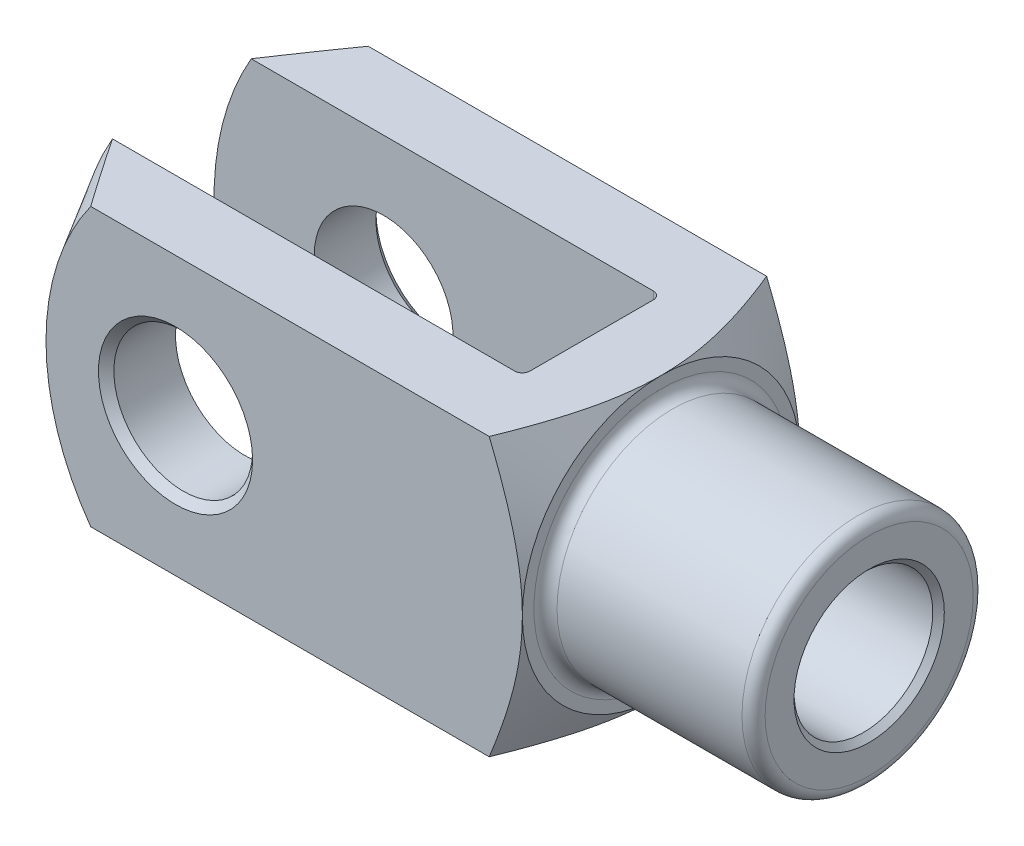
ISO-10303-21;
HEADER;
FILE_DESCRIPTION(('STEP AP214'),'2;1');
FILE_NAME('part.step','',(''),(''),'','','');
FILE_SCHEMA(('AUTOMOTIVE_DESIGN { 1 0 10303 214 1 1 1 1 }'));
ENDSEC;
DATA;
#1=APPLICATION_CONTEXT('core data for automotive mechanical design processes');
#2=APPLICATION_PROTOCOL_DEFINITION('international standard','automotive_design',2000,#1);
#3=PRODUCT_CONTEXT('',#1,'mechanical');
#4=PRODUCT('Part','Part','',(#3));
#5=PRODUCT_RELATED_PRODUCT_CATEGORY('part','',(#4));
#6=PRODUCT_DEFINITION_FORMATION('','',#4);
#7=PRODUCT_DEFINITION_CONTEXT('part definition',#1,'design');
#8=PRODUCT_DEFINITION('design','',#6,#7);
#9=PRODUCT_DEFINITION_SHAPE('','',#8);
#10=(LENGTH_UNIT() NAMED_UNIT(*) SI_UNIT(.MILLI.,.METRE.));
#11=(NAMED_UNIT(*) PLANE_ANGLE_UNIT() SI_UNIT($,.RADIAN.));
#12=(NAMED_UNIT(*) SI_UNIT($,.STERADIAN.) SOLID_ANGLE_UNIT());
#13=UNCERTAINTY_MEASURE_WITH_UNIT(LENGTH_MEASURE(1.E-05),#10,'distance_accuracy_value','');
#14=(GEOMETRIC_REPRESENTATION_CONTEXT(3) GLOBAL_UNCERTAINTY_ASSIGNED_CONTEXT((#13)) GLOBAL_UNIT_ASSIGNED_CONTEXT((#10,
#11,#12)) REPRESENTATION_CONTEXT('',''));
#15=CARTESIAN_POINT('',(0.,0.,0.));
#16=DIRECTION('',(0.,0.,1.));
#17=DIRECTION('',(1.,0.,0.));
#18=AXIS2_PLACEMENT_3D('',#15,#16,#17);
#19=CARTESIAN_POINT('',(-37.,-18.,-7.99999999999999));
#20=DIRECTION('',(0.,-1.,0.));
#21=DIRECTION('',(0.,0.,-1.));
#22=AXIS2_PLACEMENT_3D('',#19,#20,#21);
#23=CYLINDRICAL_SURFACE('',#22,1.);
#24=DIRECTION('',(0.,1.,0.));
#25=VECTOR('',#24,1.);
#26=CARTESIAN_POINT('',(-36.,-18.,-7.99999999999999));
#27=LINE('',#26,#25);
#28=CARTESIAN_POINT('',(-36.,-4.12310562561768,-7.99999999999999));
#29=VERTEX_POINT('',#28);
#30=CARTESIAN_POINT('',(-36.,-18.,-7.99999999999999));
#31=VERTEX_POINT('',#30);
#32=EDGE_CURVE('E359',#29,#31,#27,.F.);
#33=ORIENTED_EDGE('',*,*,#32,.F.);
#34=CARTESIAN_POINT('',(-36.,-4.12310562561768,-7.99999999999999));
#35=CARTESIAN_POINT('',(-36.0000126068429,-4.05795313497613,-8.03358080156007));
#36=CARTESIAN_POINT('',(-36.0016908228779,-3.99240500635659,-8.06635429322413));
#37=CARTESIAN_POINT('',(-36.0079935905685,-3.86066972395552,-8.13022612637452));
#38=CARTESIAN_POINT('',(-36.0126168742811,-3.7944828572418,-8.16132518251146));
#39=CARTESIAN_POINT('',(-36.0244135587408,-3.66170122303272,-8.22175508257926));
#40=CARTESIAN_POINT('',(-36.0315817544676,-3.59510755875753,-8.2510893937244));
#41=CARTESIAN_POINT('',(-36.0481648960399,-3.46146330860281,-8.30804124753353));
#42=CARTESIAN_POINT('',(-36.0575801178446,-3.3944126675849,-8.33565857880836));
#43=CARTESIAN_POINT('',(-36.0886937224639,-3.19328216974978,-8.41568207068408));
#44=CARTESIAN_POINT('',(-36.1133182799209,-3.05862477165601,-8.4655318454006));
#45=CARTESIAN_POINT('',(-36.1686833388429,-2.78816872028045,-8.55842204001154));
#46=CARTESIAN_POINT('',(-36.1994280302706,-2.65236934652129,-8.60145775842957));
#47=CARTESIAN_POINT('',(-36.2826691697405,-2.31014076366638,-8.70110757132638));
#48=CARTESIAN_POINT('',(-36.3382386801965,-2.10317829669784,-8.75337877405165));
#49=CARTESIAN_POINT('',(-36.4566899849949,-1.6881686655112,-8.8428051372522));
#50=CARTESIAN_POINT('',(-36.5195736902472,-1.48012123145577,-8.87995633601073));
#51=CARTESIAN_POINT('',(-36.7151062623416,-0.854721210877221,-8.96921099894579));
#52=CARTESIAN_POINT('',(-36.8546656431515,-0.436003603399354,-8.99914633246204));
#53=CARTESIAN_POINT('',(-36.9960000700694,-0.0119998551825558,-8.99999399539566));
#54=CARTESIAN_POINT('',(-36.9980000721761,-0.00599985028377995,-8.99999999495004));
#55=CARTESIAN_POINT('',(-37.,0.,-8.99999999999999));
#56=B_SPLINE_CURVE_WITH_KNOTS('',3,(#34,#35,#36,#37,#38,#39,#40,#41,#42,#43,#44,#45,#46,#47,#48,
#49,#50,#51,#52,#53,#54,#55),.UNSPECIFIED.,.F.,.F.,(4,2,2,2,2,2,2,2,2,2,4),(0.,
0.219841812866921,0.439589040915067,0.658889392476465,0.87821669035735,1.31489484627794,
1.75187299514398,2.4127768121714,3.07385368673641,4.39566422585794,4.41463790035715),.UNSPECIFIED.);
#57=CARTESIAN_POINT('',(-37.,0.,-8.99999999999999));
#58=VERTEX_POINT('',#57);
#59=EDGE_CURVE('E391',#29,#58,#56,.T.);
#60=ORIENTED_EDGE('',*,*,#59,.T.);
#61=DIRECTION('',(0.,1.,0.));
#62=VECTOR('',#61,1.);
#63=CARTESIAN_POINT('',(-37.,18.,-8.99999999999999));
#64=LINE('',#63,#62);
#65=CARTESIAN_POINT('',(-37.,-18.,-8.99999999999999));
#66=VERTEX_POINT('',#65);
#67=EDGE_CURVE('E183',#66,#58,#64,.T.);
#68=ORIENTED_EDGE('',*,*,#67,.F.);
#69=CARTESIAN_POINT('',(-37.,-18.,-7.99999999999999));
#70=DIRECTION('',(0.,-1.,0.));
#71=DIRECTION('',(0.,0.,-1.));
#72=AXIS2_PLACEMENT_3D('',#69,#70,#71);
#73=CIRCLE('',#72,1.);
#74=EDGE_CURVE('E198',#31,#66,#73,.F.);
#75=ORIENTED_EDGE('',*,*,#74,.F.);
#76=EDGE_LOOP('',(#33,#60,#68,#75));
#77=FACE_BOUND('',#76,.T.);
#78=ADVANCED_FACE('F37',(#77),#23,.F.);
#79=CARTESIAN_POINT('',(-36.,-18.,-8.99999999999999));
#80=DIRECTION('',(1.,0.,0.));
#81=DIRECTION('',(0.,0.,-1.));
#82=AXIS2_PLACEMENT_3D('',#79,#80,#81);
#83=PLANE('',#82);
#84=CARTESIAN_POINT('',(-36.,18.,-7.99999999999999));
#85=VERTEX_POINT('',#84);
#86=CARTESIAN_POINT('',(-36.,4.12310562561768,-7.99999999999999));
#87=VERTEX_POINT('',#86);
#88=EDGE_CURVE('E375',#85,#87,#27,.F.);
#89=ORIENTED_EDGE('',*,*,#88,.T.);
#90=CARTESIAN_POINT('',(-36.,0.,0.));
#91=DIRECTION('',(1.,0.,0.));
#92=DIRECTION('',(0.,0.,-1.));
#93=AXIS2_PLACEMENT_3D('',#90,#91,#92);
#94=CIRCLE('',#93,9.);
#95=CARTESIAN_POINT('',(-36.,4.12310562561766,8.));
#96=VERTEX_POINT('',#95);
#97=EDGE_CURVE('E416',#87,#96,#94,.T.);
#98=ORIENTED_EDGE('',*,*,#97,.T.);
#99=DIRECTION('',(0.,1.,0.));
#100=VECTOR('',#99,1.);
#101=CARTESIAN_POINT('',(-36.,18.,8.));
#102=LINE('',#101,#100);
#103=CARTESIAN_POINT('',(-36.,18.,8.));
#104=VERTEX_POINT('',#103);
#105=EDGE_CURVE('E160',#96,#104,#102,.T.);
#106=ORIENTED_EDGE('',*,*,#105,.T.);
#107=DIRECTION('',(0.,0.,-1.));
#108=VECTOR('',#107,1.);
#109=CARTESIAN_POINT('',(-36.,18.,-8.99999999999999));
#110=LINE('',#109,#108);
#111=EDGE_CURVE('E339',#104,#85,#110,.T.);
#112=ORIENTED_EDGE('',*,*,#111,.T.);
#113=EDGE_LOOP('',(#89,#98,#106,#112));
#114=FACE_BOUND('',#113,.T.);
#115=ADVANCED_FACE('F465',(#114),#83,.F.);
#116=CARTESIAN_POINT('',(-37.,-18.,8.));
#117=DIRECTION('',(0.,-1.,0.));
#118=DIRECTION('',(0.,0.,-1.));
#119=AXIS2_PLACEMENT_3D('',#116,#117,#118);
#120=CYLINDRICAL_SURFACE('',#119,1.);
#121=ORIENTED_EDGE('',*,*,#105,.F.);
#122=CARTESIAN_POINT('',(-36.,4.12310562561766,8.));
#123=CARTESIAN_POINT('',(-36.0000126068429,4.05795313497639,8.03358080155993));
#124=CARTESIAN_POINT('',(-36.0016908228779,3.99240500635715,8.06635429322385));
#125=CARTESIAN_POINT('',(-36.0079935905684,3.86066972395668,8.13022612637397));
#126=CARTESIAN_POINT('',(-36.0126168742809,3.79448285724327,8.16132518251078));
#127=CARTESIAN_POINT('',(-36.0244135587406,3.66170122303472,8.22175508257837));
#128=CARTESIAN_POINT('',(-36.0315817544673,3.59510755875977,8.25108939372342));
#129=CARTESIAN_POINT('',(-36.0481648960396,3.46146330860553,8.30804124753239));
#130=CARTESIAN_POINT('',(-36.0575801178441,3.39441266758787,8.33565857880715));
#131=CARTESIAN_POINT('',(-36.0886937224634,3.19328216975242,8.41568207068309));
#132=CARTESIAN_POINT('',(-36.1133182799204,3.05862477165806,8.46553184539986));
#133=CARTESIAN_POINT('',(-36.1686833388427,2.78816872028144,8.55842204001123));
#134=CARTESIAN_POINT('',(-36.1994280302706,2.6523693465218,8.60145775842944));
#135=CARTESIAN_POINT('',(-36.2826691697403,2.31014076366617,8.70110757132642));
#136=CARTESIAN_POINT('',(-36.3382386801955,2.10317829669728,8.75337877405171));
#137=CARTESIAN_POINT('',(-36.4566899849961,1.68816866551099,8.84280513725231));
#138=CARTESIAN_POINT('',(-36.5195736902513,1.48012123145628,8.87995633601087));
#139=CARTESIAN_POINT('',(-36.7151062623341,0.854721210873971,8.96921099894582));
#140=CARTESIAN_POINT('',(-36.8546656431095,0.436003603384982,8.99914633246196));
#141=CARTESIAN_POINT('',(-36.9960000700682,0.0119998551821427,8.99999399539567));
#142=CARTESIAN_POINT('',(-36.9980000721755,0.00599985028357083,8.99999999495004));
#143=CARTESIAN_POINT('',(-37.,0.,9.));
#144=B_SPLINE_CURVE_WITH_KNOTS('',3,(#122,#123,#124,#125,#126,#127,#128,#129,#130,#131,#132,
#133,#134,#135,#136,#137,#138,#139,#140,#141,#142,#143),.UNSPECIFIED.,.F.,.F.,(4,2,2,2,2,2,2,2,
2,2,4),(0.,0.219841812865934,0.439589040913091,0.658889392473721,0.878216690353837,
1.31489484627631,1.75187299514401,2.41277681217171,3.07385368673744,4.39566422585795,
4.41463790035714),.UNSPECIFIED.);
#145=CARTESIAN_POINT('',(-37.,0.,9.));
#146=VERTEX_POINT('',#145);
#147=EDGE_CURVE('E145',#96,#146,#144,.T.);
#148=ORIENTED_EDGE('',*,*,#147,.T.);
#149=DIRECTION('',(0.,1.,0.));
#150=VECTOR('',#149,1.);
#151=CARTESIAN_POINT('',(-37.,-18.,9.));
#152=LINE('',#151,#150);
#153=CARTESIAN_POINT('',(-37.,18.,9.));
#154=VERTEX_POINT('',#153);
#155=EDGE_CURVE('E159',#154,#146,#152,.F.);
#156=ORIENTED_EDGE('',*,*,#155,.F.);
#157=CARTESIAN_POINT('',(-37.,18.,8.));
#158=DIRECTION('',(0.,1.,0.));
#159=DIRECTION('',(0.,0.,1.));
#160=AXIS2_PLACEMENT_3D('',#157,#158,#159);
#161=CIRCLE('',#160,1.);
#162=EDGE_CURVE('E190',#104,#154,#161,.F.);
#163=ORIENTED_EDGE('',*,*,#162,.F.);
#164=EDGE_LOOP('',(#121,#148,#156,#163));
#165=FACE_BOUND('',#164,.T.);
#166=ADVANCED_FACE('F156',(#165),#120,.F.);
#167=CARTESIAN_POINT('',(-94.,-18.,-8.99999999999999));
#168=DIRECTION('',(0.,0.,-1.));
#169=DIRECTION('',(-1.,0.,0.));
#170=AXIS2_PLACEMENT_3D('',#167,#168,#169);
#171=PLANE('',#170);
#172=CARTESIAN_POINT('',(-72.,0.,-8.99999999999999));
#173=DIRECTION('',(0.,0.,-1.));
#174=DIRECTION('',(-1.,0.,0.));
#175=AXIS2_PLACEMENT_3D('',#172,#173,#174);
#176=CIRCLE('',#175,9.);
#177=CARTESIAN_POINT('',(-81.,0.,-8.99999999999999));
#178=VERTEX_POINT('',#177);
#179=EDGE_CURVE('E369',#178,#178,#176,.F.);
#180=ORIENTED_EDGE('',*,*,#179,.F.);
#181=EDGE_LOOP('',(#180));
#182=FACE_BOUND('',#181,.T.);
#183=CARTESIAN_POINT('',(-58.,0.,-8.99999999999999));
#184=DIRECTION('',(0.,0.,1.));
#185=DIRECTION('',(1.,0.,0.));
#186=AXIS2_PLACEMENT_3D('',#183,#184,#185);
#187=CIRCLE('',#186,36.);
#188=CARTESIAN_POINT('',(-89.1769145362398,18.,-8.99999999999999));
#189=VERTEX_POINT('',#188);
#190=CARTESIAN_POINT('',(-89.1769145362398,-18.,-8.99999999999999));
#191=VERTEX_POINT('',#190);
#192=EDGE_CURVE('E277',#189,#191,#187,.T.);
#193=ORIENTED_EDGE('',*,*,#192,.T.);
#194=DIRECTION('',(-1.,0.,0.));
#195=VECTOR('',#194,1.);
#196=CARTESIAN_POINT('',(-94.,-18.,-8.99999999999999));
#197=LINE('',#196,#195);
#198=EDGE_CURVE('E334',#66,#191,#197,.T.);
#199=ORIENTED_EDGE('',*,*,#198,.F.);
#200=ORIENTED_EDGE('',*,*,#67,.T.);
#201=CARTESIAN_POINT('',(-37.,18.,-8.99999999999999));
#202=VERTEX_POINT('',#201);
#203=EDGE_CURVE('E179',#58,#202,#64,.T.);
#204=ORIENTED_EDGE('',*,*,#203,.T.);
#205=DIRECTION('',(-1.,0.,0.));
#206=VECTOR('',#205,1.);
#207=CARTESIAN_POINT('',(-94.,18.,-8.99999999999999));
#208=LINE('',#207,#206);
#209=EDGE_CURVE('E347',#202,#189,#208,.T.);
#210=ORIENTED_EDGE('',*,*,#209,.T.);
#211=EDGE_LOOP('',(#193,#199,#200,#204,#210));
#212=FACE_BOUND('',#211,.T.);
#213=ADVANCED_FACE('F394',(#182,#212),#171,.F.);
#214=CARTESIAN_POINT('',(-94.,-18.,9.00000000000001));
#215=DIRECTION('',(0.,0.,1.));
#216=DIRECTION('',(1.,0.,0.));
#217=AXIS2_PLACEMENT_3D('',#214,#215,#216);
#218=PLANE('',#217);
#219=CARTESIAN_POINT('',(-72.,0.,9.00000000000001));
#220=DIRECTION('',(0.,0.,1.));
#221=DIRECTION('',(1.,0.,0.));
#222=AXIS2_PLACEMENT_3D('',#219,#220,#221);
#223=CIRCLE('',#222,9.);
#224=CARTESIAN_POINT('',(-63.,0.,9.00000000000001));
#225=VERTEX_POINT('',#224);
#226=EDGE_CURVE('E346',#225,#225,#223,.F.);
#227=ORIENTED_EDGE('',*,*,#226,.F.);
#228=EDGE_LOOP('',(#227));
#229=FACE_BOUND('',#228,.T.);
#230=DIRECTION('',(1.,0.,0.));
#231=VECTOR('',#230,1.);
#232=CARTESIAN_POINT('',(-94.,-18.,9.00000000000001));
#233=LINE('',#232,#231);
#234=CARTESIAN_POINT('',(-89.1769145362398,-18.,9.00000000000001));
#235=VERTEX_POINT('',#234);
#236=CARTESIAN_POINT('',(-37.,-18.,9.));
#237=VERTEX_POINT('',#236);
#238=EDGE_CURVE('E338',#235,#237,#233,.T.);
#239=ORIENTED_EDGE('',*,*,#238,.F.);
#240=CARTESIAN_POINT('',(-58.,0.,9.00000000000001));
#241=DIRECTION('',(0.,0.,1.));
#242=DIRECTION('',(1.,0.,0.));
#243=AXIS2_PLACEMENT_3D('',#240,#241,#242);
#244=CIRCLE('',#243,36.);
#245=CARTESIAN_POINT('',(-89.1769145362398,18.,9.00000000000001));
#246=VERTEX_POINT('',#245);
#247=EDGE_CURVE('E422',#246,#235,#244,.T.);
#248=ORIENTED_EDGE('',*,*,#247,.F.);
#249=DIRECTION('',(1.,0.,0.));
#250=VECTOR('',#249,1.);
#251=CARTESIAN_POINT('',(-94.,18.,9.00000000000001));
#252=LINE('',#251,#250);
#253=EDGE_CURVE('E176',#246,#154,#252,.T.);
#254=ORIENTED_EDGE('',*,*,#253,.T.);
#255=ORIENTED_EDGE('',*,*,#155,.T.);
#256=EDGE_CURVE('E164',#146,#237,#152,.F.);
#257=ORIENTED_EDGE('',*,*,#256,.T.);
#258=EDGE_LOOP('',(#239,#248,#254,#255,#257));
#259=FACE_BOUND('',#258,.T.);
#260=ADVANCED_FACE('F173',(#229,#259),#218,.F.);
#261=CARTESIAN_POINT('',(-94.,-18.,18.));
#262=DIRECTION('',(0.,0.,1.));
#263=DIRECTION('',(1.,0.,0.));
#264=AXIS2_PLACEMENT_3D('',#261,#262,#263);
#265=PLANE('',#264);
#266=CARTESIAN_POINT('',(-72.,0.,18.));
#267=DIRECTION('',(0.,0.,1.));
#268=DIRECTION('',(1.,0.,0.));
#269=AXIS2_PLACEMENT_3D('',#266,#267,#268);
#270=CIRCLE('',#269,10.);
#271=CARTESIAN_POINT('',(-62.,0.,18.));
#272=VERTEX_POINT('',#271);
#273=EDGE_CURVE('E229',#272,#272,#270,.F.);
#274=ORIENTED_EDGE('',*,*,#273,.T.);
#275=EDGE_LOOP('',(#274));
#276=FACE_BOUND('',#275,.T.);
#277=DIRECTION('',(1.,0.,0.));
#278=VECTOR('',#277,1.);
#279=CARTESIAN_POINT('',(-94.,18.,18.));
#280=LINE('',#279,#278);
#281=CARTESIAN_POINT('',(-82.9975403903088,18.,18.));
#282=VERTEX_POINT('',#281);
#283=CARTESIAN_POINT('',(-31.3046336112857,18.,18.));
#284=VERTEX_POINT('',#283);
#285=EDGE_CURVE('E366',#282,#284,#280,.T.);
#286=ORIENTED_EDGE('',*,*,#285,.F.);
#287=CARTESIAN_POINT('',(-58.,0.,18.));
#288=DIRECTION('',(0.,0.,1.));
#289=DIRECTION('',(1.,0.,0.));
#290=AXIS2_PLACEMENT_3D('',#287,#288,#289);
#291=CIRCLE('',#290,30.8038475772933);
#292=CARTESIAN_POINT('',(-82.9975403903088,-18.,18.));
#293=VERTEX_POINT('',#292);
#294=EDGE_CURVE('E61',#282,#293,#291,.T.);
#295=ORIENTED_EDGE('',*,*,#294,.T.);
#296=DIRECTION('',(1.,0.,0.));
#297=VECTOR('',#296,1.);
#298=CARTESIAN_POINT('',(-94.,-18.,18.));
#299=LINE('',#298,#297);
#300=CARTESIAN_POINT('',(-31.3046336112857,-18.,18.));
#301=VERTEX_POINT('',#300);
#302=EDGE_CURVE('E363',#293,#301,#299,.T.);
#303=ORIENTED_EDGE('',*,*,#302,.T.);
#304=CARTESIAN_POINT('',(-40.2405722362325,-36.7632783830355,18.));
#305=CARTESIAN_POINT('',(-40.0105725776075,-36.3197153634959,18.));
#306=CARTESIAN_POINT('',(-39.7812032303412,-35.8758256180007,18.));
#307=CARTESIAN_POINT('',(-39.3238600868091,-34.9873260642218,18.));
#308=CARTESIAN_POINT('',(-39.0958862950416,-34.5427162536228,18.));
#309=CARTESIAN_POINT('',(-38.4142399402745,-33.2076661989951,18.));
#310=CARTESIAN_POINT('',(-37.9628656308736,-32.3160500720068,18.));
#311=CARTESIAN_POINT('',(-37.0668423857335,-30.5274977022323,18.));
#312=CARTESIAN_POINT('',(-36.6222065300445,-29.6305548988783,18.));
#313=CARTESIAN_POINT('',(-35.742288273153,-27.8321038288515,18.));
#314=CARTESIAN_POINT('',(-35.3070057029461,-26.9305956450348,18.));
#315=CARTESIAN_POINT('',(-34.4217688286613,-25.0663534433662,18.));
#316=CARTESIAN_POINT('',(-33.9725594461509,-24.103264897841,18.));
#317=CARTESIAN_POINT('',(-33.0912213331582,-22.1691957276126,18.));
#318=CARTESIAN_POINT('',(-32.6590934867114,-21.19821469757,18.));
#319=CARTESIAN_POINT('',(-32.0279376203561,-19.7346450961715,18.));
#320=CARTESIAN_POINT('',(-31.8204335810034,-19.2457093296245,18.));
#321=CARTESIAN_POINT('',(-31.4119626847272,-18.2651149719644,18.));
#322=CARTESIAN_POINT('',(-31.2109957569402,-17.7734564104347,18.));
#323=CARTESIAN_POINT('',(-30.8166365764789,-16.7871551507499,18.));
#324=CARTESIAN_POINT('',(-30.623243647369,-16.292512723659,18.));
#325=CARTESIAN_POINT('',(-30.2452342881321,-15.2998877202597,18.));
#326=CARTESIAN_POINT('',(-30.0606177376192,-14.8019051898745,18.));
#327=CARTESIAN_POINT('',(-29.6626454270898,-13.6938703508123,18.));
#328=CARTESIAN_POINT('',(-29.4517390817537,-13.0829330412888,18.));
#329=CARTESIAN_POINT('',(-29.0480757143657,-11.855117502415,18.));
#330=CARTESIAN_POINT('',(-28.8553171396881,-11.2382397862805,18.));
#331=CARTESIAN_POINT('',(-28.4915272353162,-9.99807877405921,18.));
#332=CARTESIAN_POINT('',(-28.3204954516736,-9.37479561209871,18.));
#333=CARTESIAN_POINT('',(-28.0042438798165,-8.1216622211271,18.));
#334=CARTESIAN_POINT('',(-27.8590238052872,-7.49181206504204,18.));
#335=CARTESIAN_POINT('',(-27.6018286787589,-6.24070277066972,18.));
#336=CARTESIAN_POINT('',(-27.4891532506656,-5.61958903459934,18.));
#337=CARTESIAN_POINT('',(-27.2965642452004,-4.37225988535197,18.));
#338=CARTESIAN_POINT('',(-27.2166496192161,-3.74604463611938,18.));
#339=CARTESIAN_POINT('',(-27.0929227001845,-2.49042427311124,18.));
#340=CARTESIAN_POINT('',(-27.0490868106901,-1.86102151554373,18.));
#341=CARTESIAN_POINT('',(-26.9994512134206,-0.600711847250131,18.));
#342=CARTESIAN_POINT('',(-26.9936501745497,0.030195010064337,18.));
#343=CARTESIAN_POINT('',(-27.0193731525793,1.24522213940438,18.));
#344=CARTESIAN_POINT('',(-27.0482082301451,1.82940177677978,18.));
#345=CARTESIAN_POINT('',(-27.1376196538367,2.99530093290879,18.));
#346=CARTESIAN_POINT('',(-27.1981959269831,3.57702045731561,18.));
#347=CARTESIAN_POINT('',(-27.34886904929,4.73688551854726,18.));
#348=CARTESIAN_POINT('',(-27.438981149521,5.31502905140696,18.));
#349=CARTESIAN_POINT('',(-27.6457548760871,6.46651779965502,18.));
#350=CARTESIAN_POINT('',(-27.7624172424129,7.03986288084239,18.));
#351=CARTESIAN_POINT('',(-28.0227602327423,8.19779167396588,18.));
#352=CARTESIAN_POINT('',(-28.1671251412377,8.78222035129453,18.));
#353=CARTESIAN_POINT('',(-28.4770472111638,9.94539252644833,18.));
#354=CARTESIAN_POINT('',(-28.6426045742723,10.5241359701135,18.));
#355=CARTESIAN_POINT('',(-28.9917080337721,11.6761185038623,18.));
#356=CARTESIAN_POINT('',(-29.1752533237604,12.2493578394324,18.));
#357=CARTESIAN_POINT('',(-29.4619599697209,13.1053541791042,18.));
#358=CARTESIAN_POINT('',(-29.5594253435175,13.3900380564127,18.));
#359=CARTESIAN_POINT('',(-29.7578505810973,13.9581848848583,18.));
#360=CARTESIAN_POINT('',(-29.8588104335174,14.2416478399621,18.));
#361=CARTESIAN_POINT('',(-30.1832067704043,15.1363970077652,18.));
#362=CARTESIAN_POINT('',(-30.412533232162,15.7455526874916,18.));
#363=CARTESIAN_POINT('',(-30.8836375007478,16.9590446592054,18.));
#364=CARTESIAN_POINT('',(-31.1254160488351,17.5633806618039,18.));
#365=CARTESIAN_POINT('',(-31.6194138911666,18.7679201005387,18.));
#366=CARTESIAN_POINT('',(-31.8716355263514,19.3681225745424,18.));
#367=CARTESIAN_POINT('',(-32.3847822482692,20.5647731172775,18.));
#368=CARTESIAN_POINT('',(-32.6457071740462,21.1612212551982,18.));
#369=CARTESIAN_POINT('',(-33.1751260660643,22.3513599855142,18.));
#370=CARTESIAN_POINT('',(-33.443626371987,22.9450477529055,18.));
#371=CARTESIAN_POINT('',(-33.9868624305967,24.1295621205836,18.));
#372=CARTESIAN_POINT('',(-34.2615982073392,24.7203887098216,18.));
#373=CARTESIAN_POINT('',(-34.8163538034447,25.8994690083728,18.));
#374=CARTESIAN_POINT('',(-35.0963730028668,26.4877230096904,18.));
#375=CARTESIAN_POINT('',(-35.6609782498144,27.6620368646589,18.));
#376=CARTESIAN_POINT('',(-35.9455643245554,28.2480967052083,18.));
#377=CARTESIAN_POINT('',(-36.8069484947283,30.006950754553,18.));
#378=CARTESIAN_POINT('',(-37.3896789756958,31.1768405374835,18.));
#379=CARTESIAN_POINT('',(-38.5670559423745,33.5106205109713,18.));
#380=CARTESIAN_POINT('',(-39.1617026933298,34.6745105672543,18.));
#381=CARTESIAN_POINT('',(-40.3599132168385,36.9969592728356,18.));
#382=CARTESIAN_POINT('',(-40.9634724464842,38.1555202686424,18.));
#383=CARTESIAN_POINT('',(-42.1778240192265,40.4688291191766,18.));
#384=CARTESIAN_POINT('',(-42.7886163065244,41.6235770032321,18.));
#385=CARTESIAN_POINT('',(-43.9248536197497,43.7587282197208,18.));
#386=CARTESIAN_POINT('',(-44.4495025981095,44.7395555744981,18.));
#387=CARTESIAN_POINT('',(-45.5023194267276,46.6993204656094,18.));
#388=CARTESIAN_POINT('',(-46.0304872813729,47.6782579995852,18.));
#389=CARTESIAN_POINT('',(-47.6195621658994,50.6129487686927,18.));
#390=CARTESIAN_POINT('',(-48.6848943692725,52.5663063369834,18.));
#391=CARTESIAN_POINT('',(-50.2862726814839,55.4872150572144,18.));
#392=CARTESIAN_POINT('',(-50.819085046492,56.4565433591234,18.));
#393=CARTESIAN_POINT('',(-51.8865645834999,58.3941789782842,18.));
#394=CARTESIAN_POINT('',(-52.4212317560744,59.3624862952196,18.));
#395=CARTESIAN_POINT('',(-53.4920885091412,61.2980584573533,18.));
#396=CARTESIAN_POINT('',(-54.0282778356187,62.2653234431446,18.));
#397=CARTESIAN_POINT('',(-55.1020695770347,64.1990673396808,18.));
#398=CARTESIAN_POINT('',(-55.6396719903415,65.1655462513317,18.));
#399=CARTESIAN_POINT('',(-56.1778848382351,66.1316848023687,18.));
#400=B_SPLINE_CURVE_WITH_KNOTS('',3,(#304,#305,#306,#307,#308,#309,#310,#311,#312,#313,#314,
#315,#316,#317,#318,#319,#320,#321,#322,#323,#324,#325,#326,#327,#328,#329,#330,#331,#332,#333,
#334,#335,#336,#337,#338,#339,#340,#341,#342,#343,#344,#345,#346,#347,#348,#349,#350,#351,#352,
#353,#354,#355,#356,#357,#358,#359,#360,#361,#362,#363,#364,#365,#366,#367,#368,#369,#370,#371,
#372,#373,#374,#375,#376,#377,#378,#379,#380,#381,#382,#383,#384,#385,#386,#387,#388,#389,#390,
#391,#392,#393,#394,#395,#396,#397,#398,#399),.UNSPECIFIED.,.F.,.F.,(4,2,2,2,2,2,2,2,2,2,2,2,2,
2,2,2,2,2,2,2,2,2,2,2,2,2,2,2,2,2,2,2,2,2,2,2,2,2,2,2,2,2,2,2,2,2,2,4),(0.,1.49894265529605,
2.99789013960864,5.99593634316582,8.99920323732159,12.0024158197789,15.1903943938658,
18.37853774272,19.9719380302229,21.5653210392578,23.1585614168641,24.7517799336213,
26.6904915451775,28.6290371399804,30.5675422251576,32.5060258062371,34.3990052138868,
36.2919240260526,38.1836038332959,40.0752174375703,41.8289960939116,43.5827707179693,
45.3374523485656,47.0921828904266,48.8977025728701,50.7032394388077,52.5086953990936,
53.411394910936,54.3140914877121,56.2665854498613,58.2191957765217,60.1722461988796,
62.1252605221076,64.0799608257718,66.0346686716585,67.9891485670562,69.9436401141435,
73.864500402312,77.7854480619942,81.7044617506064,85.6234452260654,88.9604281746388,
92.2974152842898,98.9723206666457,102.290659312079,105.608998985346,108.926814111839,
112.244625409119),.UNSPECIFIED.);
#401=CARTESIAN_POINT('',(-27.,0.,18.));
#402=VERTEX_POINT('',#401);
#403=EDGE_CURVE('E306',#402,#301,#400,.F.);
#404=ORIENTED_EDGE('',*,*,#403,.F.);
#405=EDGE_CURVE('E304',#284,#402,#400,.F.);
#406=ORIENTED_EDGE('',*,*,#405,.F.);
#407=EDGE_LOOP('',(#286,#295,#303,#404,#406));
#408=FACE_BOUND('',#407,.T.);
#409=ADVANCED_FACE('F288',(#276,#408),#265,.T.);
#410=CARTESIAN_POINT('',(-94.,-18.,18.));
#411=DIRECTION('',(0.,-1.,0.));
#412=DIRECTION('',(0.,0.,-1.));
#413=AXIS2_PLACEMENT_3D('',#410,#411,#412);
#414=PLANE('',#413);
#415=ORIENTED_EDGE('',*,*,#198,.T.);
#416=CARTESIAN_POINT('',(-103.41784238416,-18.,13.2649703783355));
#417=CARTESIAN_POINT('',(-102.979965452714,-18.,12.5599029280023));
#418=CARTESIAN_POINT('',(-102.541471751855,-18.,11.8552185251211));
#419=CARTESIAN_POINT('',(-101.663133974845,-18.,10.4466909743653));
#420=CARTESIAN_POINT('',(-101.223289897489,-18.,9.74284782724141));
#421=CARTESIAN_POINT('',(-99.9015410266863,-18.,7.63266776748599));
#422=CARTESIAN_POINT('',(-99.0174364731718,-18.,6.22770743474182));
#423=CARTESIAN_POINT('',(-97.2411537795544,-18.,3.42054643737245));
#424=CARTESIAN_POINT('',(-96.3489672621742,-18.,2.01835106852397));
#425=CARTESIAN_POINT('',(-95.0042911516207,-18.,-0.0808333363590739));
#426=CARTESIAN_POINT('',(-94.5550021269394,-18.,-0.779872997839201));
#427=CARTESIAN_POINT('',(-93.6540505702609,-18.,-2.17642782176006));
#428=CARTESIAN_POINT('',(-93.2023880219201,-18.,-2.87394297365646));
#429=CARTESIAN_POINT('',(-91.805754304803,-18.,-5.02193188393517));
#430=CARTESIAN_POINT('',(-90.8564015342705,-18.,-6.46956195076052));
#431=CARTESIAN_POINT('',(-88.9433785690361,-18.,-9.35533210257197));
#432=CARTESIAN_POINT('',(-87.9797085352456,-18.,-10.7934722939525));
#433=CARTESIAN_POINT('',(-86.5206774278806,-18.,-12.9407207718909));
#434=CARTESIAN_POINT('',(-86.0322614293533,-18.,-13.6545493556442));
#435=CARTESIAN_POINT('',(-85.0501071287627,-18.,-15.0785415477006));
#436=CARTESIAN_POINT('',(-84.5563688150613,-18.,-15.7887051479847));
#437=CARTESIAN_POINT('',(-83.5627811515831,-18.,-17.2046996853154));
#438=CARTESIAN_POINT('',(-83.0629320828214,-18.,-17.9105308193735));
#439=CARTESIAN_POINT('',(-82.0561048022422,-18.,-19.3170848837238));
#440=CARTESIAN_POINT('',(-81.5491266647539,-18.,-20.0178078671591));
#441=CARTESIAN_POINT('',(-80.531566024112,-18.,-21.4066300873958));
#442=CARTESIAN_POINT('',(-80.0210611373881,-18.,-22.0947861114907));
#443=CARTESIAN_POINT('',(-78.9903313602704,-18.,-23.4638130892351));
#444=CARTESIAN_POINT('',(-78.4701062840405,-18.,-24.1446839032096));
#445=CARTESIAN_POINT('',(-77.4173327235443,-18.,-25.4983549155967));
#446=CARTESIAN_POINT('',(-76.8847682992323,-18.,-26.1711427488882));
#447=CARTESIAN_POINT('',(-75.8056076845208,-18.,-27.5053350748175));
#448=CARTESIAN_POINT('',(-75.2590122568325,-18.,-28.1667401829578));
#449=CARTESIAN_POINT('',(-74.1543598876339,-18.,-29.4682414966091));
#450=CARTESIAN_POINT('',(-73.5964806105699,-18.,-30.1084875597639));
#451=CARTESIAN_POINT('',(-72.7439263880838,-18.,-31.0548465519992));
#452=CARTESIAN_POINT('',(-72.4570726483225,-18.,-31.3680127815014));
#453=CARTESIAN_POINT('',(-71.8775081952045,-18.,-31.9888708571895));
#454=CARTESIAN_POINT('',(-71.5847976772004,-18.,-32.2965628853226));
#455=CARTESIAN_POINT('',(-70.9934617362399,-18.,-32.9048915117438));
#456=CARTESIAN_POINT('',(-70.6948509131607,-18.,-33.2055422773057));
#457=CARTESIAN_POINT('',(-70.0902529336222,-18.,-33.7993806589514));
#458=CARTESIAN_POINT('',(-69.784265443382,-18.,-34.0925679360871));
#459=CARTESIAN_POINT('',(-69.1641708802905,-18.,-34.6698930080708));
#460=CARTESIAN_POINT('',(-68.8500684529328,-18.,-34.9540357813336));
#461=CARTESIAN_POINT('',(-68.212559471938,-18.,-35.511647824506));
#462=CARTESIAN_POINT('',(-67.8891542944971,-18.,-35.7851186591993));
#463=CARTESIAN_POINT('',(-67.3903285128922,-18.,-36.1903940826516));
#464=CARTESIAN_POINT('',(-67.2187423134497,-18.,-36.3269269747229));
#465=CARTESIAN_POINT('',(-66.8725822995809,-18.,-36.5961477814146));
#466=CARTESIAN_POINT('',(-66.6980084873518,-18.,-36.7288356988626));
#467=CARTESIAN_POINT('',(-66.1694658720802,-18.,-37.1205720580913));
#468=CARTESIAN_POINT('',(-65.8107218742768,-18.,-37.3732554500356));
#469=CARTESIAN_POINT('',(-65.0794835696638,-18.,-37.8573350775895));
#470=CARTESIAN_POINT('',(-64.7070003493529,-18.,-38.0887479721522));
#471=CARTESIAN_POINT('',(-63.9468949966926,-18.,-38.5253159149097));
#472=CARTESIAN_POINT('',(-63.5592768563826,-18.,-38.7304778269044));
#473=CARTESIAN_POINT('',(-62.8586737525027,-18.,-39.0650981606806));
#474=CARTESIAN_POINT('',(-62.5488453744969,-18.,-39.2011478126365));
#475=CARTESIAN_POINT('',(-61.9201168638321,-18.,-39.4505194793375));
#476=CARTESIAN_POINT('',(-61.6012175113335,-18.,-39.5638434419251));
#477=CARTESIAN_POINT('',(-60.9556690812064,-18.,-39.7641785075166));
#478=CARTESIAN_POINT('',(-60.6290314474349,-18.,-39.8512261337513));
#479=CARTESIAN_POINT('',(-59.9692664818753,-18.,-39.99600700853));
#480=CARTESIAN_POINT('',(-59.6361394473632,-18.,-40.0537415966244));
#481=CARTESIAN_POINT('',(-58.9625132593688,-18.,-40.137846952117));
#482=CARTESIAN_POINT('',(-58.6219737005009,-18.,-40.1638984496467));
#483=CARTESIAN_POINT('',(-57.9399876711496,-18.,-40.1823341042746));
#484=CARTESIAN_POINT('',(-57.5985412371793,-18.,-40.1747195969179));
#485=CARTESIAN_POINT('',(-56.9179820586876,-18.,-40.1261912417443));
#486=CARTESIAN_POINT('',(-56.5788697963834,-18.,-40.0852707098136));
#487=CARTESIAN_POINT('',(-55.9059547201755,-18.,-39.9720133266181));
#488=CARTESIAN_POINT('',(-55.5721527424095,-18.,-39.8996715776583));
#489=CARTESIAN_POINT('',(-54.8509499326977,-18.,-39.7104873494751));
#490=CARTESIAN_POINT('',(-54.4650678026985,-18.,-39.5878855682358));
#491=CARTESIAN_POINT('',(-53.7058176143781,-18.,-39.30844830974));
#492=CARTESIAN_POINT('',(-53.3324566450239,-18.,-39.1515938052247));
#493=CARTESIAN_POINT('',(-52.7819431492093,-18.,-38.8947743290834));
#494=CARTESIAN_POINT('',(-52.5997347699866,-18.,-38.8054133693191));
#495=CARTESIAN_POINT('',(-52.2387189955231,-18.,-38.6202385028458));
#496=CARTESIAN_POINT('',(-52.0599101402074,-18.,-38.5244274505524));
#497=CARTESIAN_POINT('',(-51.7055718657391,-18.,-38.3269455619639));
#498=CARTESIAN_POINT('',(-51.5300423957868,-18.,-38.2252748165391));
#499=CARTESIAN_POINT('',(-51.1821454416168,-18.,-38.0166187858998));
#500=CARTESIAN_POINT('',(-51.0097784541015,-18.,-37.9096326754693));
#501=CARTESIAN_POINT('',(-50.3852837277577,-18.,-37.5098055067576));
#502=CARTESIAN_POINT('',(-49.942376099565,-18.,-37.2024738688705));
#503=CARTESIAN_POINT('',(-49.0756132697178,-18.,-36.5619753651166));
#504=CARTESIAN_POINT('',(-48.6517672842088,-18.,-36.228796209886));
#505=CARTESIAN_POINT('',(-47.8198735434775,-18.,-35.5417740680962));
#506=CARTESIAN_POINT('',(-47.4118578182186,-18.,-35.1878924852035));
#507=CARTESIAN_POINT('',(-46.610225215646,-18.,-34.4643996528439));
#508=CARTESIAN_POINT('',(-46.2166059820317,-18.,-34.0947909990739));
#509=CARTESIAN_POINT('',(-45.4390660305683,-18.,-33.3404359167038));
#510=CARTESIAN_POINT('',(-45.0552278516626,-18.,-32.9556047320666));
#511=CARTESIAN_POINT('',(-44.2982514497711,-18.,-32.1755673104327));
#512=CARTESIAN_POINT('',(-43.9251135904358,-18.,-31.7803607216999));
#513=CARTESIAN_POINT('',(-43.1884717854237,-18.,-30.9818482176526));
#514=CARTESIAN_POINT('',(-42.8249582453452,-18.,-30.5785511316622));
#515=CARTESIAN_POINT('',(-42.1059592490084,-18.,-29.7648935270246));
#516=CARTESIAN_POINT('',(-41.7504736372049,-18.,-29.3545331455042));
#517=CARTESIAN_POINT('',(-40.9006293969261,-18.,-28.3565840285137));
#518=CARTESIAN_POINT('',(-40.409766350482,-18.,-27.7660198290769));
#519=CARTESIAN_POINT('',(-39.4395922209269,-18.,-26.5753176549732));
#520=CARTESIAN_POINT('',(-38.9602834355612,-18.,-25.9751778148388));
#521=CARTESIAN_POINT('',(-38.0187402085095,-18.,-24.7764597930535));
#522=CARTESIAN_POINT('',(-37.556356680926,-18.,-24.1779985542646));
#523=CARTESIAN_POINT('',(-36.8689319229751,-18.,-23.2757755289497));
#524=CARTESIAN_POINT('',(-36.6408485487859,-18.,-22.9743240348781));
#525=CARTESIAN_POINT('',(-36.1865643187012,-18.,-22.3700102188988));
#526=CARTESIAN_POINT('',(-35.9603634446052,-18.,-22.0671479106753));
#527=CARTESIAN_POINT('',(-35.7350296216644,-18.,-21.7636413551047));
#528=B_SPLINE_CURVE_WITH_KNOTS('',3,(#416,#417,#418,#419,#420,#421,#422,#423,#424,#425,#426,
#427,#428,#429,#430,#431,#432,#433,#434,#435,#436,#437,#438,#439,#440,#441,#442,#443,#444,#445,
#446,#447,#448,#449,#450,#451,#452,#453,#454,#455,#456,#457,#458,#459,#460,#461,#462,#463,#464,
#465,#466,#467,#468,#469,#470,#471,#472,#473,#474,#475,#476,#477,#478,#479,#480,#481,#482,#483,
#484,#485,#486,#487,#488,#489,#490,#491,#492,#493,#494,#495,#496,#497,#498,#499,#500,#501,#502,
#503,#504,#505,#506,#507,#508,#509,#510,#511,#512,#513,#514,#515,#516,#517,#518,#519,#520,#521,
#522,#523,#524,#525,#526,#527),.UNSPECIFIED.,.F.,.F.,(4,2,2,2,2,2,2,2,2,2,2,2,2,2,2,2,2,2,2,2,2,
2,2,2,2,2,2,2,2,2,2,2,2,2,2,2,2,2,2,2,2,2,2,2,2,2,2,2,2,2,2,2,2,2,2,4),(0.,2.4899205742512,
4.9798433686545,9.95978498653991,14.9456708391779,17.4385873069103,19.9315209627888,
25.1249266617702,30.3182740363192,32.913040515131,35.5078126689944,38.1024659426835,
40.6970921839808,43.2675392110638,45.8380354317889,48.4120611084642,50.9859471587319,
53.5331386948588,54.8071360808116,56.0810910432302,57.3522132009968,58.6233929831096,
59.89386051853,61.1641410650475,61.8219278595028,62.4797141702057,63.7954649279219,
65.1101762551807,66.4245431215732,67.4389384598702,68.4532468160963,69.4661387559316,
70.4789844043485,71.5019540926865,72.5248831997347,73.5480176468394,74.5713116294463,
75.7840629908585,76.9974897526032,77.6062093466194,78.2146613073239,78.8231038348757,
79.4316411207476,81.0475307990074,82.664193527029,84.2839727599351,85.9034856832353,
87.5338373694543,89.1642443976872,90.7929597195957,92.4216434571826,94.7252323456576,
97.0292756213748,99.2980191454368,100.432057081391,101.566084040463),.UNSPECIFIED.);
#529=CARTESIAN_POINT('',(-82.9975403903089,-18.,-18.));
#530=VERTEX_POINT('',#529);
#531=EDGE_CURVE('E276',#191,#530,#528,.T.);
#532=ORIENTED_EDGE('',*,*,#531,.T.);
#533=DIRECTION('',(1.,0.,0.));
#534=VECTOR('',#533,1.);
#535=CARTESIAN_POINT('',(-94.,-18.,-18.));
#536=LINE('',#535,#534);
#537=CARTESIAN_POINT('',(-31.3046336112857,-18.,-18.));
#538=VERTEX_POINT('',#537);
#539=EDGE_CURVE('E360',#530,#538,#536,.T.);
#540=ORIENTED_EDGE('',*,*,#539,.T.);
#541=CARTESIAN_POINT('',(-40.2405722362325,-18.,-36.7632783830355));
#542=CARTESIAN_POINT('',(-40.0105725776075,-18.,-36.3197153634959));
#543=CARTESIAN_POINT('',(-39.7812032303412,-18.,-35.8758256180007));
#544=CARTESIAN_POINT('',(-39.3238600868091,-18.,-34.9873260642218));
#545=CARTESIAN_POINT('',(-39.0958862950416,-18.,-34.5427162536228));
#546=CARTESIAN_POINT('',(-38.4142399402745,-18.,-33.2076661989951));
#547=CARTESIAN_POINT('',(-37.9628656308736,-18.,-32.3160500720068));
#548=CARTESIAN_POINT('',(-37.0668423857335,-18.,-30.5274977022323));
#549=CARTESIAN_POINT('',(-36.6222065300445,-18.,-29.6305548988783));
#550=CARTESIAN_POINT('',(-35.742288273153,-18.,-27.8321038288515));
#551=CARTESIAN_POINT('',(-35.3070057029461,-18.,-26.9305956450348));
#552=CARTESIAN_POINT('',(-34.4217688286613,-18.,-25.0663534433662));
#553=CARTESIAN_POINT('',(-33.9725594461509,-18.,-24.103264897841));
#554=CARTESIAN_POINT('',(-33.0912213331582,-18.,-22.1691957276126));
#555=CARTESIAN_POINT('',(-32.6590934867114,-18.,-21.19821469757));
#556=CARTESIAN_POINT('',(-32.0279376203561,-18.,-19.7346450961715));
#557=CARTESIAN_POINT('',(-31.8204335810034,-18.,-19.2457093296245));
#558=CARTESIAN_POINT('',(-31.4119626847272,-18.,-18.2651149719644));
#559=CARTESIAN_POINT('',(-31.2109957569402,-18.,-17.7734564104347));
#560=CARTESIAN_POINT('',(-30.8166365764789,-18.,-16.7871551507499));
#561=CARTESIAN_POINT('',(-30.623243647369,-18.,-16.292512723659));
#562=CARTESIAN_POINT('',(-30.2452342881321,-18.,-15.2998877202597));
#563=CARTESIAN_POINT('',(-30.0606177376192,-18.,-14.8019051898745));
#564=CARTESIAN_POINT('',(-29.6626454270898,-18.,-13.6938703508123));
#565=CARTESIAN_POINT('',(-29.4517390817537,-18.,-13.0829330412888));
#566=CARTESIAN_POINT('',(-29.0480757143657,-18.,-11.855117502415));
#567=CARTESIAN_POINT('',(-28.8553171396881,-18.,-11.2382397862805));
#568=CARTESIAN_POINT('',(-28.4915272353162,-18.,-9.99807877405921));
#569=CARTESIAN_POINT('',(-28.3204954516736,-18.,-9.37479561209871));
#570=CARTESIAN_POINT('',(-28.0042438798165,-18.,-8.1216622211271));
#571=CARTESIAN_POINT('',(-27.8590238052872,-18.,-7.49181206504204));
#572=CARTESIAN_POINT('',(-27.6018286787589,-18.,-6.24070277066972));
#573=CARTESIAN_POINT('',(-27.4891532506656,-18.,-5.61958903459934));
#574=CARTESIAN_POINT('',(-27.2965642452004,-18.,-4.37225988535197));
#575=CARTESIAN_POINT('',(-27.2166496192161,-18.,-3.74604463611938));
#576=CARTESIAN_POINT('',(-27.0929227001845,-18.,-2.49042427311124));
#577=CARTESIAN_POINT('',(-27.0490868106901,-18.,-1.86102151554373));
#578=CARTESIAN_POINT('',(-26.9994512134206,-18.,-0.600711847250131));
#579=CARTESIAN_POINT('',(-26.9936501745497,-18.,0.030195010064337));
#580=CARTESIAN_POINT('',(-27.0193731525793,-18.,1.24522213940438));
#581=CARTESIAN_POINT('',(-27.0482082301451,-18.,1.82940177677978));
#582=CARTESIAN_POINT('',(-27.1376196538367,-18.,2.99530093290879));
#583=CARTESIAN_POINT('',(-27.1981959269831,-18.,3.57702045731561));
#584=CARTESIAN_POINT('',(-27.34886904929,-18.,4.73688551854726));
#585=CARTESIAN_POINT('',(-27.438981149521,-18.,5.31502905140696));
#586=CARTESIAN_POINT('',(-27.6457548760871,-18.,6.46651779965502));
#587=CARTESIAN_POINT('',(-27.7624172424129,-18.,7.03986288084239));
#588=CARTESIAN_POINT('',(-28.0227602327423,-18.,8.19779167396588));
#589=CARTESIAN_POINT('',(-28.1671251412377,-18.,8.78222035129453));
#590=CARTESIAN_POINT('',(-28.4770472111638,-18.,9.94539252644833));
#591=CARTESIAN_POINT('',(-28.6426045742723,-18.,10.5241359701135));
#592=CARTESIAN_POINT('',(-28.9917080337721,-18.,11.6761185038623));
#593=CARTESIAN_POINT('',(-29.1752533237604,-18.,12.2493578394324));
#594=CARTESIAN_POINT('',(-29.4619599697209,-18.,13.1053541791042));
#595=CARTESIAN_POINT('',(-29.5594253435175,-18.,13.3900380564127));
#596=CARTESIAN_POINT('',(-29.7578505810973,-18.,13.9581848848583));
#597=CARTESIAN_POINT('',(-29.8588104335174,-18.,14.2416478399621));
#598=CARTESIAN_POINT('',(-30.1832067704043,-18.,15.1363970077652));
#599=CARTESIAN_POINT('',(-30.412533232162,-18.,15.7455526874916));
#600=CARTESIAN_POINT('',(-30.8836375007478,-18.,16.9590446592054));
#601=CARTESIAN_POINT('',(-31.1254160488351,-18.,17.5633806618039));
#602=CARTESIAN_POINT('',(-31.6194138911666,-18.,18.7679201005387));
#603=CARTESIAN_POINT('',(-31.8716355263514,-18.,19.3681225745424));
#604=CARTESIAN_POINT('',(-32.3847822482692,-18.,20.5647731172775));
#605=CARTESIAN_POINT('',(-32.6457071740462,-18.,21.1612212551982));
#606=CARTESIAN_POINT('',(-33.1751260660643,-18.,22.3513599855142));
#607=CARTESIAN_POINT('',(-33.443626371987,-18.,22.9450477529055));
#608=CARTESIAN_POINT('',(-33.9868624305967,-18.,24.1295621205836));
#609=CARTESIAN_POINT('',(-34.2615982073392,-18.,24.7203887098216));
#610=CARTESIAN_POINT('',(-34.8163538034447,-18.,25.8994690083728));
#611=CARTESIAN_POINT('',(-35.0963730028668,-18.,26.4877230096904));
#612=CARTESIAN_POINT('',(-35.6609782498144,-18.,27.6620368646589));
#613=CARTESIAN_POINT('',(-35.9455643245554,-18.,28.2480967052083));
#614=CARTESIAN_POINT('',(-36.8069484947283,-18.,30.006950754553));
#615=CARTESIAN_POINT('',(-37.3896789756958,-18.,31.1768405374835));
#616=CARTESIAN_POINT('',(-38.5670559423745,-18.,33.5106205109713));
#617=CARTESIAN_POINT('',(-39.1617026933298,-18.,34.6745105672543));
#618=CARTESIAN_POINT('',(-40.3599132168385,-18.,36.9969592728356));
#619=CARTESIAN_POINT('',(-40.9634724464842,-18.,38.1555202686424));
#620=CARTESIAN_POINT('',(-42.1778240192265,-18.,40.4688291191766));
#621=CARTESIAN_POINT('',(-42.7886163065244,-18.,41.6235770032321));
#622=CARTESIAN_POINT('',(-43.9248536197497,-18.,43.7587282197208));
#623=CARTESIAN_POINT('',(-44.4495025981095,-18.,44.7395555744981));
#624=CARTESIAN_POINT('',(-45.5023194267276,-18.,46.6993204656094));
#625=CARTESIAN_POINT('',(-46.0304872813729,-18.,47.6782579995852));
#626=CARTESIAN_POINT('',(-47.6195621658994,-18.,50.6129487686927));
#627=CARTESIAN_POINT('',(-48.6848943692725,-18.,52.5663063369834));
#628=CARTESIAN_POINT('',(-50.2862726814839,-18.,55.4872150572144));
#629=CARTESIAN_POINT('',(-50.819085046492,-18.,56.4565433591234));
#630=CARTESIAN_POINT('',(-51.8865645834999,-18.,58.3941789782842));
#631=CARTESIAN_POINT('',(-52.4212317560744,-18.,59.3624862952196));
#632=CARTESIAN_POINT('',(-53.4920885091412,-18.,61.2980584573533));
#633=CARTESIAN_POINT('',(-54.0282778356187,-18.,62.2653234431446));
#634=CARTESIAN_POINT('',(-55.1020695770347,-18.,64.1990673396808));
#635=CARTESIAN_POINT('',(-55.6396719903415,-18.,65.1655462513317));
#636=CARTESIAN_POINT('',(-56.1778848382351,-18.,66.1316848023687));
#637=B_SPLINE_CURVE_WITH_KNOTS('',3,(#541,#542,#543,#544,#545,#546,#547,#548,#549,#550,#551,
#552,#553,#554,#555,#556,#557,#558,#559,#560,#561,#562,#563,#564,#565,#566,#567,#568,#569,#570,
#571,#572,#573,#574,#575,#576,#577,#578,#579,#580,#581,#582,#583,#584,#585,#586,#587,#588,#589,
#590,#591,#592,#593,#594,#595,#596,#597,#598,#599,#600,#601,#602,#603,#604,#605,#606,#607,#608,
#609,#610,#611,#612,#613,#614,#615,#616,#617,#618,#619,#620,#621,#622,#623,#624,#625,#626,#627,
#628,#629,#630,#631,#632,#633,#634,#635,#636),.UNSPECIFIED.,.F.,.F.,(4,2,2,2,2,2,2,2,2,2,2,2,2,
2,2,2,2,2,2,2,2,2,2,2,2,2,2,2,2,2,2,2,2,2,2,2,2,2,2,2,2,2,2,2,2,2,2,4),(0.,1.49894265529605,
2.99789013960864,5.99593634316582,8.99920323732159,12.0024158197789,15.1903943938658,
18.37853774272,19.9719380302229,21.5653210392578,23.1585614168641,24.7517799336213,
26.6904915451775,28.6290371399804,30.5675422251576,32.5060258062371,34.3990052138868,
36.2919240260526,38.1836038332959,40.0752174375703,41.8289960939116,43.5827707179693,
45.3374523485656,47.0921828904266,48.8977025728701,50.7032394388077,52.5086953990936,
53.411394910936,54.3140914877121,56.2665854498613,58.2191957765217,60.1722461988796,
62.1252605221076,64.0799608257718,66.0346686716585,67.9891485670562,69.9436401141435,
73.864500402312,77.7854480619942,81.7044617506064,85.6234452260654,88.9604281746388,
92.2974152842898,98.9723206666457,102.290659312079,105.608998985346,108.926814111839,
112.244625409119),.UNSPECIFIED.);
#638=CARTESIAN_POINT('',(-27.,-18.,0.));
#639=VERTEX_POINT('',#638);
#640=EDGE_CURVE('E305',#639,#538,#637,.F.);
#641=ORIENTED_EDGE('',*,*,#640,.F.);
#642=EDGE_CURVE('E296',#301,#639,#637,.F.);
#643=ORIENTED_EDGE('',*,*,#642,.F.);
#644=ORIENTED_EDGE('',*,*,#302,.F.);
#645=CARTESIAN_POINT('',(-35.7350296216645,-18.,21.7636413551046));
#646=CARTESIAN_POINT('',(-36.1011453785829,-18.,22.2567287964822));
#647=CARTESIAN_POINT('',(-36.4695238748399,-18.,22.7481490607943));
#648=CARTESIAN_POINT('',(-37.21151995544,-18.,23.7270709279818));
#649=CARTESIAN_POINT('',(-37.5851379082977,-18.,24.214572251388));
#650=CARTESIAN_POINT('',(-38.3389429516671,-18.,25.1858627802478));
#651=CARTESIAN_POINT('',(-38.7191405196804,-18.,25.6696438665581));
#652=CARTESIAN_POINT('',(-39.4863079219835,-18.,26.6317955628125));
#653=CARTESIAN_POINT('',(-39.873277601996,-18.,27.1101662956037));
#654=CARTESIAN_POINT('',(-40.6588692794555,-18.,28.0651790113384));
#655=CARTESIAN_POINT('',(-41.0575684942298,-18.,28.5417575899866));
#656=CARTESIAN_POINT('',(-41.8641922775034,-18.,29.4870381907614));
#657=CARTESIAN_POINT('',(-42.272116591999,-18.,29.9557404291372));
#658=CARTESIAN_POINT('',(-43.0984878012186,-18.,30.8832446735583));
#659=CARTESIAN_POINT('',(-43.516927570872,-18.,31.3420530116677));
#660=CARTESIAN_POINT('',(-44.3664574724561,-18.,32.2477682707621));
#661=CARTESIAN_POINT('',(-44.7975462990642,-18.,32.6946764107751));
#662=CARTESIAN_POINT('',(-45.6055249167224,-18.,33.5041675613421));
#663=CARTESIAN_POINT('',(-45.980229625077,-18.,33.868926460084));
#664=CARTESIAN_POINT('',(-46.7420377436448,-18.,34.5853916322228));
#665=CARTESIAN_POINT('',(-47.1291423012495,-18.,34.9370966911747));
#666=CARTESIAN_POINT('',(-47.9179070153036,-18.,35.6243319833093));
#667=CARTESIAN_POINT('',(-48.3195752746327,-18.,35.9598529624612));
#668=CARTESIAN_POINT('',(-49.1394767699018,-18.,36.6100817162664));
#669=CARTESIAN_POINT('',(-49.55770799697,-18.,36.9247920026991));
#670=CARTESIAN_POINT('',(-50.3529253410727,-18.,37.4850330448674));
#671=CARTESIAN_POINT('',(-50.7274310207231,-18.,37.7340661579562));
#672=CARTESIAN_POINT('',(-51.4919476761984,-18.,38.2074585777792));
#673=CARTESIAN_POINT('',(-51.8819609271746,-18.,38.4318142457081));
#674=CARTESIAN_POINT('',(-52.6770888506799,-18.,38.8488921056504));
#675=CARTESIAN_POINT('',(-53.0821502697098,-18.,39.0417148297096));
#676=CARTESIAN_POINT('',(-53.9083715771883,-18.,39.3891038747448));
#677=CARTESIAN_POINT('',(-54.3295213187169,-18.,39.5436938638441));
#678=CARTESIAN_POINT('',(-55.0510098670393,-18.,39.7652311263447));
#679=CARTESIAN_POINT('',(-55.3475953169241,-18.,39.8444452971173));
#680=CARTESIAN_POINT('',(-55.9461898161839,-18.,39.9788318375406));
#681=CARTESIAN_POINT('',(-56.2481980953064,-18.,40.0340075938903));
#682=CARTESIAN_POINT('',(-56.855660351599,-18.,40.1183717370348));
#683=CARTESIAN_POINT('',(-57.1611120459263,-18.,40.1475764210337));
#684=CARTESIAN_POINT('',(-57.7734200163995,-18.,40.178949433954));
#685=CARTESIAN_POINT('',(-58.0802763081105,-18.,40.181117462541));
#686=CARTESIAN_POINT('',(-58.693112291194,-18.,40.1583245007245));
#687=CARTESIAN_POINT('',(-58.9990915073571,-18.,40.1333508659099));
#688=CARTESIAN_POINT('',(-59.6077415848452,-18.,40.057215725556));
#689=CARTESIAN_POINT('',(-59.910412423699,-18.,40.0060540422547));
#690=CARTESIAN_POINT('',(-60.5107091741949,-18.,39.8793234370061));
#691=CARTESIAN_POINT('',(-60.8083325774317,-18.,39.8037427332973));
#692=CARTESIAN_POINT('',(-61.3970633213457,-18.,39.630533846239));
#693=CARTESIAN_POINT('',(-61.6881697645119,-18.,39.5329026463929));
#694=CARTESIAN_POINT('',(-62.4256361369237,-18.,39.2574180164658));
#695=CARTESIAN_POINT('',(-62.866723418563,-18.,39.0654161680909));
#696=CARTESIAN_POINT('',(-63.7302100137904,-18.,38.6431266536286));
#697=CARTESIAN_POINT('',(-64.15259639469,-18.,38.4128130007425));
#698=CARTESIAN_POINT('',(-64.7734457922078,-18.,38.0442972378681));
#699=CARTESIAN_POINT('',(-64.9786971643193,-18.,37.9173227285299));
#700=CARTESIAN_POINT('',(-65.3848728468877,-18.,37.6566148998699));
#701=CARTESIAN_POINT('',(-65.5857971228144,-18.,37.522881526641));
#702=CARTESIAN_POINT('',(-65.9834344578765,-18.,37.2494918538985));
#703=CARTESIAN_POINT('',(-66.1801492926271,-18.,37.1098381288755));
#704=CARTESIAN_POINT('',(-66.5696826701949,-18.,36.8252192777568));
#705=CARTESIAN_POINT('',(-66.7625012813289,-18.,36.6802542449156));
#706=CARTESIAN_POINT('',(-67.3399883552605,-18.,36.234796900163));
#707=CARTESIAN_POINT('',(-67.7190249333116,-18.,35.9269827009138));
#708=CARTESIAN_POINT('',(-68.4640697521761,-18.,35.2959083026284));
#709=CARTESIAN_POINT('',(-68.8300746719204,-18.,34.9726442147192));
#710=CARTESIAN_POINT('',(-69.5510064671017,-18.,34.3133660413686));
#711=CARTESIAN_POINT('',(-69.9059226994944,-18.,33.9773403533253));
#712=CARTESIAN_POINT('',(-70.6057601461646,-18.,33.2951284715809));
#713=CARTESIAN_POINT('',(-70.9506821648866,-18.,32.9489431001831));
#714=CARTESIAN_POINT('',(-71.6330380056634,-18.,32.246893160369));
#715=CARTESIAN_POINT('',(-71.9704408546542,-18.,31.8909985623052));
#716=CARTESIAN_POINT('',(-72.6375782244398,-18.,31.1720975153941));
#717=CARTESIAN_POINT('',(-72.9673126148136,-18.,30.8090909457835));
#718=CARTESIAN_POINT('',(-73.6198738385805,-18.,30.0772501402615));
#719=CARTESIAN_POINT('',(-73.942703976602,-18.,29.7084188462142));
#720=CARTESIAN_POINT('',(-74.5824088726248,-18.,28.9656216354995));
#721=CARTESIAN_POINT('',(-74.8992834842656,-18.,28.5916555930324));
#722=CARTESIAN_POINT('',(-75.849783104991,-18.,27.4538505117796));
#723=CARTESIAN_POINT('',(-76.4752491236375,-18.,26.6831898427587));
#724=CARTESIAN_POINT('',(-77.709062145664,-18.,25.1282369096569));
#725=CARTESIAN_POINT('',(-78.3174074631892,-18.,24.3439433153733));
#726=CARTESIAN_POINT('',(-79.5188839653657,-18.,22.766508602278));
#727=CARTESIAN_POINT('',(-80.1120454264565,-18.,21.9733904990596));
#728=CARTESIAN_POINT('',(-81.2870153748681,-18.,20.37877868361));
#729=CARTESIAN_POINT('',(-81.8688236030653,-18.,19.577284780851));
#730=CARTESIAN_POINT('',(-82.9203719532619,-18.,18.1106345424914));
#731=CARTESIAN_POINT('',(-83.3916449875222,-18.,17.4465751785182));
#732=CARTESIAN_POINT('',(-84.3286451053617,-18.,16.114552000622));
#733=CARTESIAN_POINT('',(-84.7943721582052,-18.,15.4465881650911));
#734=CARTESIAN_POINT('',(-85.7209979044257,-18.,14.107295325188));
#735=CARTESIAN_POINT('',(-86.1818964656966,-18.,13.4359662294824));
#736=CARTESIAN_POINT('',(-87.0994384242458,-18.,12.090405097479));
#737=CARTESIAN_POINT('',(-87.5560818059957,-18.,11.4161730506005));
#738=CARTESIAN_POINT('',(-88.9212112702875,-18.,9.38848072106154));
#739=CARTESIAN_POINT('',(-89.8240665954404,-18.,8.03122815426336));
#740=CARTESIAN_POINT('',(-91.6179075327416,-18.,5.30890727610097));
#741=CARTESIAN_POINT('',(-92.5088930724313,-18.,3.94383891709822));
#742=CARTESIAN_POINT('',(-94.2448284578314,-18.,1.26375925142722));
#743=CARTESIAN_POINT('',(-95.0901646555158,-18.,-0.0510020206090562));
#744=CARTESIAN_POINT('',(-96.7735553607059,-18.,-2.68518481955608));
#745=CARTESIAN_POINT('',(-97.6116098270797,-18.,-4.00460637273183));
#746=CARTESIAN_POINT('',(-99.2806309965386,-18.,-6.64569542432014));
#747=CARTESIAN_POINT('',(-100.111605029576,-18.,-7.96735829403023));
#748=CARTESIAN_POINT('',(-101.768377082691,-18.,-10.6138981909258));
#749=CARTESIAN_POINT('',(-102.594175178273,-18.,-11.9387751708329));
#750=CARTESIAN_POINT('',(-103.41784238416,-18.,-13.2649703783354));
#751=B_SPLINE_CURVE_WITH_KNOTS('',3,(#645,#646,#647,#648,#649,#650,#651,#652,#653,#654,#655,
#656,#657,#658,#659,#660,#661,#662,#663,#664,#665,#666,#667,#668,#669,#670,#671,#672,#673,#674,
#675,#676,#677,#678,#679,#680,#681,#682,#683,#684,#685,#686,#687,#688,#689,#690,#691,#692,#693,
#694,#695,#696,#697,#698,#699,#700,#701,#702,#703,#704,#705,#706,#707,#708,#709,#710,#711,#712,
#713,#714,#715,#716,#717,#718,#719,#720,#721,#722,#723,#724,#725,#726,#727,#728,#729,#730,#731,
#732,#733,#734,#735,#736,#737,#738,#739,#740,#741,#742,#743,#744,#745,#746,#747,#748,#749,#750),
.UNSPECIFIED.,.F.,.F.,(4,2,2,2,2,2,2,2,2,2,2,2,2,2,2,2,2,2,2,2,2,2,2,2,2,2,2,2,2,2,2,2,2,2,2,2,
2,2,2,2,2,2,2,2,2,2,2,2,2,2,2,2,4),(0.,1.84244858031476,3.68502740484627,5.53087484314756,
7.37668028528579,9.24066085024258,11.1045901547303,12.9672888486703,14.829795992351,
16.3983263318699,17.9670022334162,19.536564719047,21.1059374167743,22.4544149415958,
23.8030910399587,25.1473797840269,26.4908342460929,27.4109126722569,28.3308614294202,
29.2502324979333,30.1696137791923,31.0894235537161,32.0092395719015,32.9295000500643,
33.8498864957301,35.2906217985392,36.7323383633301,37.4562855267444,38.1802384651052,
38.9038797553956,39.6275083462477,41.0917802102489,42.5564226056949,44.0224300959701,
45.4883192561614,46.9594186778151,48.4305431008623,49.9009468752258,51.3713867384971,
54.3486375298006,57.3261804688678,60.2972321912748,63.2683516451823,65.7112002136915,
68.1540623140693,70.5969910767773,73.0399287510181,77.9301908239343,82.8204827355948,
87.5096662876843,92.1988763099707,96.8824302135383,101.565915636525),.UNSPECIFIED.);
#752=EDGE_CURVE('E267',#293,#235,#751,.T.);
#753=ORIENTED_EDGE('',*,*,#752,.T.);
#754=ORIENTED_EDGE('',*,*,#238,.T.);
#755=CARTESIAN_POINT('',(-37.,-18.,8.));
#756=DIRECTION('',(0.,-1.,0.));
#757=DIRECTION('',(0.,0.,-1.));
#758=AXIS2_PLACEMENT_3D('',#755,#756,#757);
#759=CIRCLE('',#758,1.);
#760=CARTESIAN_POINT('',(-36.,-18.,8.));
#761=VERTEX_POINT('',#760);
#762=EDGE_CURVE('E166',#237,#761,#759,.F.);
#763=ORIENTED_EDGE('',*,*,#762,.T.);
#764=DIRECTION('',(0.,0.,-1.));
#765=VECTOR('',#764,1.);
#766=CARTESIAN_POINT('',(-36.,-18.,-8.99999999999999));
#767=LINE('',#766,#765);
#768=EDGE_CURVE('E342',#761,#31,#767,.T.);
#769=ORIENTED_EDGE('',*,*,#768,.T.);
#770=ORIENTED_EDGE('',*,*,#74,.T.);
#771=EDGE_LOOP('',(#415,#532,#540,#641,#643,#644,#753,#754,#763,#769,#770));
#772=FACE_BOUND('',#771,.T.);
#773=ADVANCED_FACE('F283',(#772),#414,.T.);
#774=CARTESIAN_POINT('',(-94.,-18.,-18.));
#775=DIRECTION('',(0.,0.,-1.));
#776=DIRECTION('',(-1.,0.,0.));
#777=AXIS2_PLACEMENT_3D('',#774,#775,#776);
#778=PLANE('',#777);
#779=CARTESIAN_POINT('',(-72.,0.,-18.));
#780=DIRECTION('',(0.,0.,-1.));
#781=DIRECTION('',(-1.,0.,0.));
#782=AXIS2_PLACEMENT_3D('',#779,#780,#781);
#783=CIRCLE('',#782,10.);
#784=CARTESIAN_POINT('',(-82.,0.,-18.));
#785=VERTEX_POINT('',#784);
#786=EDGE_CURVE('E217',#785,#785,#783,.F.);
#787=ORIENTED_EDGE('',*,*,#786,.T.);
#788=EDGE_LOOP('',(#787));
#789=FACE_BOUND('',#788,.T.);
#790=ORIENTED_EDGE('',*,*,#539,.F.);
#791=CARTESIAN_POINT('',(-58.,0.,-18.));
#792=DIRECTION('',(0.,0.,1.));
#793=DIRECTION('',(1.,0.,0.));
#794=AXIS2_PLACEMENT_3D('',#791,#792,#793);
#795=CIRCLE('',#794,30.8038475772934);
#796=CARTESIAN_POINT('',(-82.9975403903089,18.,-18.));
#797=VERTEX_POINT('',#796);
#798=EDGE_CURVE('E407',#797,#530,#795,.T.);
#799=ORIENTED_EDGE('',*,*,#798,.F.);
#800=DIRECTION('',(1.,0.,0.));
#801=VECTOR('',#800,1.);
#802=CARTESIAN_POINT('',(-94.,18.,-18.));
#803=LINE('',#802,#801);
#804=CARTESIAN_POINT('',(-31.3046336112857,18.,-18.));
#805=VERTEX_POINT('',#804);
#806=EDGE_CURVE('E356',#797,#805,#803,.T.);
#807=ORIENTED_EDGE('',*,*,#806,.T.);
#808=CARTESIAN_POINT('',(-40.2405722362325,-36.7632783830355,-18.));
#809=CARTESIAN_POINT('',(-40.0105725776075,-36.3197153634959,-18.));
#810=CARTESIAN_POINT('',(-39.7812032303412,-35.8758256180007,-18.));
#811=CARTESIAN_POINT('',(-39.3238600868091,-34.9873260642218,-18.));
#812=CARTESIAN_POINT('',(-39.0958862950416,-34.5427162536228,-18.));
#813=CARTESIAN_POINT('',(-38.4142399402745,-33.2076661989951,-18.));
#814=CARTESIAN_POINT('',(-37.9628656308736,-32.3160500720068,-18.));
#815=CARTESIAN_POINT('',(-37.0668423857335,-30.5274977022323,-18.));
#816=CARTESIAN_POINT('',(-36.6222065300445,-29.6305548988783,-18.));
#817=CARTESIAN_POINT('',(-35.742288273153,-27.8321038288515,-18.));
#818=CARTESIAN_POINT('',(-35.3070057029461,-26.9305956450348,-18.));
#819=CARTESIAN_POINT('',(-34.4217688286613,-25.0663534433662,-18.));
#820=CARTESIAN_POINT('',(-33.9725594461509,-24.103264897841,-18.));
#821=CARTESIAN_POINT('',(-33.0912213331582,-22.1691957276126,-18.));
#822=CARTESIAN_POINT('',(-32.6590934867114,-21.19821469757,-18.));
#823=CARTESIAN_POINT('',(-32.0279376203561,-19.7346450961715,-18.));
#824=CARTESIAN_POINT('',(-31.8204335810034,-19.2457093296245,-18.));
#825=CARTESIAN_POINT('',(-31.4119626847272,-18.2651149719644,-18.));
#826=CARTESIAN_POINT('',(-31.2109957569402,-17.7734564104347,-18.));
#827=CARTESIAN_POINT('',(-30.8166365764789,-16.7871551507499,-18.));
#828=CARTESIAN_POINT('',(-30.623243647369,-16.292512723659,-18.));
#829=CARTESIAN_POINT('',(-30.2452342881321,-15.2998877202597,-18.));
#830=CARTESIAN_POINT('',(-30.0606177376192,-14.8019051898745,-18.));
#831=CARTESIAN_POINT('',(-29.6626454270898,-13.6938703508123,-18.));
#832=CARTESIAN_POINT('',(-29.4517390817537,-13.0829330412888,-18.));
#833=CARTESIAN_POINT('',(-29.0480757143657,-11.855117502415,-18.));
#834=CARTESIAN_POINT('',(-28.8553171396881,-11.2382397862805,-18.));
#835=CARTESIAN_POINT('',(-28.4915272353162,-9.99807877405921,-18.));
#836=CARTESIAN_POINT('',(-28.3204954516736,-9.37479561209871,-18.));
#837=CARTESIAN_POINT('',(-28.0042438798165,-8.1216622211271,-18.));
#838=CARTESIAN_POINT('',(-27.8590238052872,-7.49181206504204,-18.));
#839=CARTESIAN_POINT('',(-27.6018286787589,-6.24070277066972,-18.));
#840=CARTESIAN_POINT('',(-27.4891532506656,-5.61958903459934,-18.));
#841=CARTESIAN_POINT('',(-27.2965642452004,-4.37225988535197,-18.));
#842=CARTESIAN_POINT('',(-27.2166496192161,-3.74604463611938,-18.));
#843=CARTESIAN_POINT('',(-27.0929227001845,-2.49042427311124,-18.));
#844=CARTESIAN_POINT('',(-27.0490868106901,-1.86102151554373,-18.));
#845=CARTESIAN_POINT('',(-26.9994512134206,-0.600711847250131,-18.));
#846=CARTESIAN_POINT('',(-26.9936501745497,0.030195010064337,-18.));
#847=CARTESIAN_POINT('',(-27.0193731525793,1.24522213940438,-18.));
#848=CARTESIAN_POINT('',(-27.0482082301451,1.82940177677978,-18.));
#849=CARTESIAN_POINT('',(-27.1376196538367,2.99530093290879,-18.));
#850=CARTESIAN_POINT('',(-27.1981959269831,3.57702045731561,-18.));
#851=CARTESIAN_POINT('',(-27.34886904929,4.73688551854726,-18.));
#852=CARTESIAN_POINT('',(-27.438981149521,5.31502905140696,-18.));
#853=CARTESIAN_POINT('',(-27.6457548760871,6.46651779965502,-18.));
#854=CARTESIAN_POINT('',(-27.7624172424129,7.03986288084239,-18.));
#855=CARTESIAN_POINT('',(-28.0227602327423,8.19779167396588,-18.));
#856=CARTESIAN_POINT('',(-28.1671251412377,8.78222035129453,-18.));
#857=CARTESIAN_POINT('',(-28.4770472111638,9.94539252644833,-18.));
#858=CARTESIAN_POINT('',(-28.6426045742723,10.5241359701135,-18.));
#859=CARTESIAN_POINT('',(-28.9917080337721,11.6761185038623,-18.));
#860=CARTESIAN_POINT('',(-29.1752533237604,12.2493578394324,-18.));
#861=CARTESIAN_POINT('',(-29.4619599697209,13.1053541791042,-18.));
#862=CARTESIAN_POINT('',(-29.5594253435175,13.3900380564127,-18.));
#863=CARTESIAN_POINT('',(-29.7578505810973,13.9581848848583,-18.));
#864=CARTESIAN_POINT('',(-29.8588104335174,14.2416478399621,-18.));
#865=CARTESIAN_POINT('',(-30.1832067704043,15.1363970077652,-18.));
#866=CARTESIAN_POINT('',(-30.412533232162,15.7455526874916,-18.));
#867=CARTESIAN_POINT('',(-30.8836375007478,16.9590446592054,-18.));
#868=CARTESIAN_POINT('',(-31.1254160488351,17.5633806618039,-18.));
#869=CARTESIAN_POINT('',(-31.6194138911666,18.7679201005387,-18.));
#870=CARTESIAN_POINT('',(-31.8716355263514,19.3681225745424,-18.));
#871=CARTESIAN_POINT('',(-32.3847822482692,20.5647731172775,-18.));
#872=CARTESIAN_POINT('',(-32.6457071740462,21.1612212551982,-18.));
#873=CARTESIAN_POINT('',(-33.1751260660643,22.3513599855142,-18.));
#874=CARTESIAN_POINT('',(-33.443626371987,22.9450477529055,-18.));
#875=CARTESIAN_POINT('',(-33.9868624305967,24.1295621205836,-18.));
#876=CARTESIAN_POINT('',(-34.2615982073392,24.7203887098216,-18.));
#877=CARTESIAN_POINT('',(-34.8163538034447,25.8994690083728,-18.));
#878=CARTESIAN_POINT('',(-35.0963730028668,26.4877230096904,-18.));
#879=CARTESIAN_POINT('',(-35.6609782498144,27.6620368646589,-18.));
#880=CARTESIAN_POINT('',(-35.9455643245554,28.2480967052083,-18.));
#881=CARTESIAN_POINT('',(-36.8069484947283,30.006950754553,-18.));
#882=CARTESIAN_POINT('',(-37.3896789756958,31.1768405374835,-18.));
#883=CARTESIAN_POINT('',(-38.5670559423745,33.5106205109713,-18.));
#884=CARTESIAN_POINT('',(-39.1617026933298,34.6745105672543,-18.));
#885=CARTESIAN_POINT('',(-40.3599132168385,36.9969592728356,-18.));
#886=CARTESIAN_POINT('',(-40.9634724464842,38.1555202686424,-18.));
#887=CARTESIAN_POINT('',(-42.1778240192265,40.4688291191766,-18.));
#888=CARTESIAN_POINT('',(-42.7886163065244,41.6235770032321,-18.));
#889=CARTESIAN_POINT('',(-43.9248536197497,43.7587282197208,-18.));
#890=CARTESIAN_POINT('',(-44.4495025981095,44.7395555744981,-18.));
#891=CARTESIAN_POINT('',(-45.5023194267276,46.6993204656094,-18.));
#892=CARTESIAN_POINT('',(-46.0304872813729,47.6782579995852,-18.));
#893=CARTESIAN_POINT('',(-47.6195621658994,50.6129487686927,-18.));
#894=CARTESIAN_POINT('',(-48.6848943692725,52.5663063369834,-18.));
#895=CARTESIAN_POINT('',(-50.2862726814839,55.4872150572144,-18.));
#896=CARTESIAN_POINT('',(-50.819085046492,56.4565433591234,-18.));
#897=CARTESIAN_POINT('',(-51.8865645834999,58.3941789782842,-18.));
#898=CARTESIAN_POINT('',(-52.4212317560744,59.3624862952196,-18.));
#899=CARTESIAN_POINT('',(-53.4920885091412,61.2980584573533,-18.));
#900=CARTESIAN_POINT('',(-54.0282778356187,62.2653234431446,-18.));
#901=CARTESIAN_POINT('',(-55.1020695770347,64.1990673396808,-18.));
#902=CARTESIAN_POINT('',(-55.6396719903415,65.1655462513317,-18.));
#903=CARTESIAN_POINT('',(-56.1778848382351,66.1316848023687,-18.));
#904=B_SPLINE_CURVE_WITH_KNOTS('',3,(#808,#809,#810,#811,#812,#813,#814,#815,#816,#817,#818,
#819,#820,#821,#822,#823,#824,#825,#826,#827,#828,#829,#830,#831,#832,#833,#834,#835,#836,#837,
#838,#839,#840,#841,#842,#843,#844,#845,#846,#847,#848,#849,#850,#851,#852,#853,#854,#855,#856,
#857,#858,#859,#860,#861,#862,#863,#864,#865,#866,#867,#868,#869,#870,#871,#872,#873,#874,#875,
#876,#877,#878,#879,#880,#881,#882,#883,#884,#885,#886,#887,#888,#889,#890,#891,#892,#893,#894,
#895,#896,#897,#898,#899,#900,#901,#902,#903),.UNSPECIFIED.,.F.,.F.,(4,2,2,2,2,2,2,2,2,2,2,2,2,
2,2,2,2,2,2,2,2,2,2,2,2,2,2,2,2,2,2,2,2,2,2,2,2,2,2,2,2,2,2,2,2,2,2,4),(0.,1.49894265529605,
2.99789013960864,5.99593634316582,8.99920323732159,12.0024158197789,15.1903943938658,
18.37853774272,19.9719380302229,21.5653210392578,23.1585614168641,24.7517799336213,
26.6904915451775,28.6290371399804,30.5675422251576,32.5060258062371,34.3990052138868,
36.2919240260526,38.1836038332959,40.0752174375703,41.8289960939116,43.5827707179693,
45.3374523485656,47.0921828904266,48.8977025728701,50.7032394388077,52.5086953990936,
53.411394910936,54.3140914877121,56.2665854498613,58.2191957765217,60.1722461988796,
62.1252605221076,64.0799608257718,66.0346686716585,67.9891485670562,69.9436401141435,
73.864500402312,77.7854480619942,81.7044617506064,85.6234452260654,88.9604281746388,
92.2974152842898,98.9723206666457,102.290659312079,105.608998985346,108.926814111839,
112.244625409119),.UNSPECIFIED.);
#905=CARTESIAN_POINT('',(-27.,0.,-18.));
#906=VERTEX_POINT('',#905);
#907=EDGE_CURVE('E326',#906,#805,#904,.T.);
#908=ORIENTED_EDGE('',*,*,#907,.F.);
#909=EDGE_CURVE('E333',#538,#906,#904,.T.);
#910=ORIENTED_EDGE('',*,*,#909,.F.);
#911=EDGE_LOOP('',(#790,#799,#807,#908,#910));
#912=FACE_BOUND('',#911,.T.);
#913=ADVANCED_FACE('F287',(#789,#912),#778,.T.);
#914=CARTESIAN_POINT('',(-94.,18.,18.));
#915=DIRECTION('',(0.,1.,0.));
#916=DIRECTION('',(0.,0.,1.));
#917=AXIS2_PLACEMENT_3D('',#914,#915,#916);
#918=PLANE('',#917);
#919=ORIENTED_EDGE('',*,*,#806,.F.);
#920=CARTESIAN_POINT('',(-35.7350296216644,18.,-21.7636413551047));
#921=CARTESIAN_POINT('',(-36.1011453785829,18.,-22.2567287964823));
#922=CARTESIAN_POINT('',(-36.4695238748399,18.,-22.7481490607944));
#923=CARTESIAN_POINT('',(-37.21151995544,18.,-23.7270709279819));
#924=CARTESIAN_POINT('',(-37.5851379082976,18.,-24.214572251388));
#925=CARTESIAN_POINT('',(-38.338942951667,18.,-25.1858627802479));
#926=CARTESIAN_POINT('',(-38.7191405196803,18.,-25.6696438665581));
#927=CARTESIAN_POINT('',(-39.4863079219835,18.,-26.6317955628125));
#928=CARTESIAN_POINT('',(-39.8732776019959,18.,-27.1101662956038));
#929=CARTESIAN_POINT('',(-40.6588692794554,18.,-28.0651790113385));
#930=CARTESIAN_POINT('',(-41.0575684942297,18.,-28.5417575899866));
#931=CARTESIAN_POINT('',(-41.8641922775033,18.,-29.4870381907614));
#932=CARTESIAN_POINT('',(-42.2721165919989,18.,-29.9557404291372));
#933=CARTESIAN_POINT('',(-43.0984878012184,18.,-30.8832446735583));
#934=CARTESIAN_POINT('',(-43.5169275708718,18.,-31.3420530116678));
#935=CARTESIAN_POINT('',(-44.3664574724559,18.,-32.2477682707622));
#936=CARTESIAN_POINT('',(-44.797546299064,18.,-32.6946764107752));
#937=CARTESIAN_POINT('',(-45.6055249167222,18.,-33.5041675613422));
#938=CARTESIAN_POINT('',(-45.9802296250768,18.,-33.8689264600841));
#939=CARTESIAN_POINT('',(-46.7420377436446,18.,-34.5853916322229));
#940=CARTESIAN_POINT('',(-47.1291423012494,18.,-34.9370966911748));
#941=CARTESIAN_POINT('',(-47.9179070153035,18.,-35.6243319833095));
#942=CARTESIAN_POINT('',(-48.3195752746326,18.,-35.9598529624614));
#943=CARTESIAN_POINT('',(-49.1394767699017,18.,-36.6100817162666));
#944=CARTESIAN_POINT('',(-49.5577079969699,18.,-36.9247920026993));
#945=CARTESIAN_POINT('',(-50.3529253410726,18.,-37.4850330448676));
#946=CARTESIAN_POINT('',(-50.727431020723,18.,-37.7340661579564));
#947=CARTESIAN_POINT('',(-51.4919476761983,18.,-38.2074585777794));
#948=CARTESIAN_POINT('',(-51.8819609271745,18.,-38.4318142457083));
#949=CARTESIAN_POINT('',(-52.6770888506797,18.,-38.8488921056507));
#950=CARTESIAN_POINT('',(-53.0821502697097,18.,-39.0417148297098));
#951=CARTESIAN_POINT('',(-53.9083715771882,18.,-39.3891038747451));
#952=CARTESIAN_POINT('',(-54.3295213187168,18.,-39.5436938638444));
#953=CARTESIAN_POINT('',(-55.0510098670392,18.,-39.765231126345));
#954=CARTESIAN_POINT('',(-55.347595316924,18.,-39.8444452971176));
#955=CARTESIAN_POINT('',(-55.9461898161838,18.,-39.9788318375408));
#956=CARTESIAN_POINT('',(-56.2481980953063,18.,-40.0340075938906));
#957=CARTESIAN_POINT('',(-56.8556603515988,18.,-40.1183717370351));
#958=CARTESIAN_POINT('',(-57.1611120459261,18.,-40.147576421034));
#959=CARTESIAN_POINT('',(-57.7734200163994,18.,-40.1789494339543));
#960=CARTESIAN_POINT('',(-58.0802763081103,18.,-40.1811174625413));
#961=CARTESIAN_POINT('',(-58.6931122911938,18.,-40.1583245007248));
#962=CARTESIAN_POINT('',(-58.999091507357,18.,-40.1333508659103));
#963=CARTESIAN_POINT('',(-59.6077415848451,18.,-40.0572157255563));
#964=CARTESIAN_POINT('',(-59.9104124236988,18.,-40.0060540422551));
#965=CARTESIAN_POINT('',(-60.5107091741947,18.,-39.8793234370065));
#966=CARTESIAN_POINT('',(-60.8083325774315,18.,-39.8037427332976));
#967=CARTESIAN_POINT('',(-61.3970633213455,18.,-39.6305338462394));
#968=CARTESIAN_POINT('',(-61.6881697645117,18.,-39.5329026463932));
#969=CARTESIAN_POINT('',(-62.4256361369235,18.,-39.2574180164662));
#970=CARTESIAN_POINT('',(-62.8667234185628,18.,-39.0654161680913));
#971=CARTESIAN_POINT('',(-63.7302100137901,18.,-38.643126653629));
#972=CARTESIAN_POINT('',(-64.1525963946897,18.,-38.4128130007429));
#973=CARTESIAN_POINT('',(-64.7734457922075,18.,-38.0442972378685));
#974=CARTESIAN_POINT('',(-64.978697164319,18.,-37.9173227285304));
#975=CARTESIAN_POINT('',(-65.3848728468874,18.,-37.6566148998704));
#976=CARTESIAN_POINT('',(-65.5857971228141,18.,-37.5228815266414));
#977=CARTESIAN_POINT('',(-65.9834344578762,18.,-37.2494918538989));
#978=CARTESIAN_POINT('',(-66.1801492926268,18.,-37.109838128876));
#979=CARTESIAN_POINT('',(-66.5696826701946,18.,-36.8252192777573));
#980=CARTESIAN_POINT('',(-66.7625012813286,18.,-36.6802542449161));
#981=CARTESIAN_POINT('',(-67.3399883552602,18.,-36.2347969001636));
#982=CARTESIAN_POINT('',(-67.7190249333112,18.,-35.9269827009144));
#983=CARTESIAN_POINT('',(-68.4640697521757,18.,-35.295908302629));
#984=CARTESIAN_POINT('',(-68.83007467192,18.,-34.9726442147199));
#985=CARTESIAN_POINT('',(-69.5510064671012,18.,-34.3133660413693));
#986=CARTESIAN_POINT('',(-69.9059226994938,18.,-33.9773403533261));
#987=CARTESIAN_POINT('',(-70.605760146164,18.,-33.2951284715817));
#988=CARTESIAN_POINT('',(-70.950682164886,18.,-32.9489431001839));
#989=CARTESIAN_POINT('',(-71.6330380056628,18.,-32.2468931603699));
#990=CARTESIAN_POINT('',(-71.9704408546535,18.,-31.8909985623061));
#991=CARTESIAN_POINT('',(-72.6375782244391,18.,-31.1720975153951));
#992=CARTESIAN_POINT('',(-72.9673126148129,18.,-30.8090909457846));
#993=CARTESIAN_POINT('',(-73.6198738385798,18.,-30.0772501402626));
#994=CARTESIAN_POINT('',(-73.9427039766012,18.,-29.7084188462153));
#995=CARTESIAN_POINT('',(-74.582408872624,18.,-28.9656216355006));
#996=CARTESIAN_POINT('',(-74.8992834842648,18.,-28.5916555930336));
#997=CARTESIAN_POINT('',(-75.8497831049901,18.,-27.4538505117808));
#998=CARTESIAN_POINT('',(-76.4752491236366,18.,-26.68318984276));
#999=CARTESIAN_POINT('',(-77.709062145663,18.,-25.1282369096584));
#1000=CARTESIAN_POINT('',(-78.3174074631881,18.,-24.3439433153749));
#1001=CARTESIAN_POINT('',(-79.5188839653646,18.,-22.7665086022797));
#1002=CARTESIAN_POINT('',(-80.1120454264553,18.,-21.9733904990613));
#1003=CARTESIAN_POINT('',(-81.2870153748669,18.,-20.3787786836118));
#1004=CARTESIAN_POINT('',(-81.868823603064,18.,-19.5772847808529));
#1005=CARTESIAN_POINT('',(-82.9203719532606,18.,-18.1106345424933));
#1006=CARTESIAN_POINT('',(-83.3916449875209,18.,-17.4465751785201));
#1007=CARTESIAN_POINT('',(-84.3286451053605,18.,-16.1145520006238));
#1008=CARTESIAN_POINT('',(-84.7943721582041,18.,-15.4465881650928));
#1009=CARTESIAN_POINT('',(-85.7209979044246,18.,-14.1072953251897));
#1010=CARTESIAN_POINT('',(-86.1818964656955,18.,-13.4359662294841));
#1011=CARTESIAN_POINT('',(-87.0994384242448,18.,-12.0904050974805));
#1012=CARTESIAN_POINT('',(-87.5560818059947,18.,-11.416173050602));
#1013=CARTESIAN_POINT('',(-88.9212112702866,18.,-9.38848072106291));
#1014=CARTESIAN_POINT('',(-89.8240665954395,18.,-8.03122815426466));
#1015=CARTESIAN_POINT('',(-91.6179075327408,18.,-5.30890727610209));
#1016=CARTESIAN_POINT('',(-92.5088930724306,18.,-3.94383891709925));
#1017=CARTESIAN_POINT('',(-94.2448284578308,18.,-1.26375925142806));
#1018=CARTESIAN_POINT('',(-95.0901646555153,18.,0.0510020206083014));
#1019=CARTESIAN_POINT('',(-96.7735553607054,18.,2.68518481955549));
#1020=CARTESIAN_POINT('',(-97.6116098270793,18.,4.00460637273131));
#1021=CARTESIAN_POINT('',(-99.2806309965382,18.,6.64569542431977));
#1022=CARTESIAN_POINT('',(-100.111605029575,18.,7.96735829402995));
#1023=CARTESIAN_POINT('',(-101.768377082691,18.,10.6138981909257));
#1024=CARTESIAN_POINT('',(-102.594175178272,18.,11.9387751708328));
#1025=CARTESIAN_POINT('',(-103.41784238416,18.,13.2649703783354));
#1026=B_SPLINE_CURVE_WITH_KNOTS('',3,(#920,#921,#922,#923,#924,#925,#926,#927,#928,#929,#930,
#931,#932,#933,#934,#935,#936,#937,#938,#939,#940,#941,#942,#943,#944,#945,#946,#947,#948,#949,
#950,#951,#952,#953,#954,#955,#956,#957,#958,#959,#960,#961,#962,#963,#964,#965,#966,#967,#968,
#969,#970,#971,#972,#973,#974,#975,#976,#977,#978,#979,#980,#981,#982,#983,#984,#985,#986,#987,
#988,#989,#990,#991,#992,#993,#994,#995,#996,#997,#998,#999,#1000,#1001,#1002,#1003,#1004,#1005,
#1006,#1007,#1008,#1009,#1010,#1011,#1012,#1013,#1014,#1015,#1016,#1017,#1018,#1019,#1020,#1021,
#1022,#1023,#1024,#1025),.UNSPECIFIED.,.F.,.F.,(4,2,2,2,2,2,2,2,2,2,2,2,2,2,2,2,2,2,2,2,2,2,2,2,
2,2,2,2,2,2,2,2,2,2,2,2,2,2,2,2,2,2,2,2,2,2,2,2,2,2,2,2,4),(0.,1.84244858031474,
3.68502740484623,5.53087484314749,7.3766802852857,9.24066085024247,11.1045901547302,
12.9672888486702,14.8297959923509,16.3983263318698,17.9670022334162,19.536564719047,
21.1059374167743,22.4544149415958,23.8030910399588,25.1473797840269,26.4908342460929,
27.4109126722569,28.3308614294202,29.2502324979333,30.1696137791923,31.0894235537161,
32.0092395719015,32.9295000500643,33.8498864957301,35.2906217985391,36.73233836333,
37.4562855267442,38.180238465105,38.9038797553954,39.6275083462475,41.0917802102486,
42.5564226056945,44.0224300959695,45.4883192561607,46.9594186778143,48.4305431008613,
49.9009468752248,51.371386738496,54.3486375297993,57.3261804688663,60.297232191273,
63.2683516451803,65.7112002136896,68.1540623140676,70.5969910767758,73.0399287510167,
77.9301908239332,82.820482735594,87.5096662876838,92.1988763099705,96.8824302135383,
101.565915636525),.UNSPECIFIED.);
#1027=EDGE_CURVE('E247',#797,#189,#1026,.T.);
#1028=ORIENTED_EDGE('',*,*,#1027,.T.);
#1029=ORIENTED_EDGE('',*,*,#209,.F.);
#1030=CARTESIAN_POINT('',(-37.,18.,-7.99999999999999));
#1031=DIRECTION('',(0.,1.,0.));
#1032=DIRECTION('',(0.,0.,1.));
#1033=AXIS2_PLACEMENT_3D('',#1030,#1031,#1032);
#1034=CIRCLE('',#1033,1.);
#1035=EDGE_CURVE('E195',#202,#85,#1034,.F.);
#1036=ORIENTED_EDGE('',*,*,#1035,.T.);
#1037=ORIENTED_EDGE('',*,*,#111,.F.);
#1038=ORIENTED_EDGE('',*,*,#162,.T.);
#1039=ORIENTED_EDGE('',*,*,#253,.F.);
#1040=CARTESIAN_POINT('',(-103.41784238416,18.,-13.2649703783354));
#1041=CARTESIAN_POINT('',(-102.979965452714,18.,-12.5599029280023));
#1042=CARTESIAN_POINT('',(-102.541471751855,18.,-11.8552185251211));
#1043=CARTESIAN_POINT('',(-101.663133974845,18.,-10.4466909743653));
#1044=CARTESIAN_POINT('',(-101.22328989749,18.,-9.74284782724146));
#1045=CARTESIAN_POINT('',(-99.9015410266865,18.,-7.63266776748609));
#1046=CARTESIAN_POINT('',(-99.017436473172,18.,-6.22770743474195));
#1047=CARTESIAN_POINT('',(-97.2411537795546,18.,-3.42054643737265));
#1048=CARTESIAN_POINT('',(-96.3489672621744,18.,-2.01835106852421));
#1049=CARTESIAN_POINT('',(-95.004291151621,18.,0.0808333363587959));
#1050=CARTESIAN_POINT('',(-94.5550021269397,18.,0.77987299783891));
#1051=CARTESIAN_POINT('',(-93.6540505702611,18.,2.17642782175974));
#1052=CARTESIAN_POINT('',(-93.2023880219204,18.,2.87394297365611));
#1053=CARTESIAN_POINT('',(-91.8057543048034,18.,5.02193188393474));
#1054=CARTESIAN_POINT('',(-90.8564015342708,18.,6.46956195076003));
#1055=CARTESIAN_POINT('',(-88.9433785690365,18.,9.35533210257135));
#1056=CARTESIAN_POINT('',(-87.9797085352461,18.,10.7934722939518));
#1057=CARTESIAN_POINT('',(-86.5206774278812,18.,12.9407207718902));
#1058=CARTESIAN_POINT('',(-86.0322614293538,18.,13.6545493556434));
#1059=CARTESIAN_POINT('',(-85.0501071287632,18.,15.0785415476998));
#1060=CARTESIAN_POINT('',(-84.5563688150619,18.,15.7887051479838));
#1061=CARTESIAN_POINT('',(-83.5627811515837,18.,17.2046996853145));
#1062=CARTESIAN_POINT('',(-83.062932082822,18.,17.9105308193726));
#1063=CARTESIAN_POINT('',(-82.0561048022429,18.,19.3170848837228));
#1064=CARTESIAN_POINT('',(-81.5491266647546,18.,20.0178078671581));
#1065=CARTESIAN_POINT('',(-80.5315660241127,18.,21.4066300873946));
#1066=CARTESIAN_POINT('',(-80.0210611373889,18.,22.0947861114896));
#1067=CARTESIAN_POINT('',(-78.9903313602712,18.,23.463813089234));
#1068=CARTESIAN_POINT('',(-78.4701062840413,18.,24.1446839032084));
#1069=CARTESIAN_POINT('',(-77.4173327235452,18.,25.4983549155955));
#1070=CARTESIAN_POINT('',(-76.8847682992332,18.,26.1711427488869));
#1071=CARTESIAN_POINT('',(-75.8056076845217,18.,27.5053350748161));
#1072=CARTESIAN_POINT('',(-75.2590122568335,18.,28.1667401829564));
#1073=CARTESIAN_POINT('',(-74.1543598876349,18.,29.4682414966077));
#1074=CARTESIAN_POINT('',(-73.5964806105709,18.,30.1084875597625));
#1075=CARTESIAN_POINT('',(-72.7439263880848,18.,31.0548465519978));
#1076=CARTESIAN_POINT('',(-72.4570726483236,18.,31.3680127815));
#1077=CARTESIAN_POINT('',(-71.8775081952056,18.,31.9888708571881));
#1078=CARTESIAN_POINT('',(-71.5847976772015,18.,32.2965628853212));
#1079=CARTESIAN_POINT('',(-70.9934617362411,18.,32.9048915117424));
#1080=CARTESIAN_POINT('',(-70.6948509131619,18.,33.2055422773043));
#1081=CARTESIAN_POINT('',(-70.0902529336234,18.,33.79938065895));
#1082=CARTESIAN_POINT('',(-69.7842654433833,18.,34.0925679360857));
#1083=CARTESIAN_POINT('',(-69.1641708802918,18.,34.6698930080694));
#1084=CARTESIAN_POINT('',(-68.8500684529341,18.,34.9540357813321));
#1085=CARTESIAN_POINT('',(-68.2125594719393,18.,35.5116478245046));
#1086=CARTESIAN_POINT('',(-67.8891542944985,18.,35.7851186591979));
#1087=CARTESIAN_POINT('',(-67.3903285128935,18.,36.1903940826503));
#1088=CARTESIAN_POINT('',(-67.218742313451,18.,36.3269269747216));
#1089=CARTESIAN_POINT('',(-66.8725822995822,18.,36.5961477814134));
#1090=CARTESIAN_POINT('',(-66.6980084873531,18.,36.7288356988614));
#1091=CARTESIAN_POINT('',(-66.1694658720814,18.,37.1205720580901));
#1092=CARTESIAN_POINT('',(-65.8107218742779,18.,37.3732554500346));
#1093=CARTESIAN_POINT('',(-65.0794835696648,18.,37.8573350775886));
#1094=CARTESIAN_POINT('',(-64.7070003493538,18.,38.0887479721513));
#1095=CARTESIAN_POINT('',(-63.9468949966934,18.,38.525315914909));
#1096=CARTESIAN_POINT('',(-63.5592768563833,18.,38.7304778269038));
#1097=CARTESIAN_POINT('',(-62.8586737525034,18.,39.06509816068));
#1098=CARTESIAN_POINT('',(-62.5488453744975,18.,39.2011478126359));
#1099=CARTESIAN_POINT('',(-61.9201168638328,18.,39.450519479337));
#1100=CARTESIAN_POINT('',(-61.6012175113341,18.,39.5638434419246));
#1101=CARTESIAN_POINT('',(-60.955669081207,18.,39.7641785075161));
#1102=CARTESIAN_POINT('',(-60.6290314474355,18.,39.8512261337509));
#1103=CARTESIAN_POINT('',(-59.9692664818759,18.,39.9960070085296));
#1104=CARTESIAN_POINT('',(-59.6361394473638,18.,40.053741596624));
#1105=CARTESIAN_POINT('',(-58.9625132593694,18.,40.1378469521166));
#1106=CARTESIAN_POINT('',(-58.6219737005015,18.,40.1638984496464));
#1107=CARTESIAN_POINT('',(-57.9399876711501,18.,40.1823341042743));
#1108=CARTESIAN_POINT('',(-57.5985412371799,18.,40.1747195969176));
#1109=CARTESIAN_POINT('',(-56.9179820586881,18.,40.126191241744));
#1110=CARTESIAN_POINT('',(-56.5788697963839,18.,40.0852707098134));
#1111=CARTESIAN_POINT('',(-55.905954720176,18.,39.9720133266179));
#1112=CARTESIAN_POINT('',(-55.5721527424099,18.,39.8996715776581));
#1113=CARTESIAN_POINT('',(-54.8509499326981,18.,39.7104873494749));
#1114=CARTESIAN_POINT('',(-54.465067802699,18.,39.5878855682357));
#1115=CARTESIAN_POINT('',(-53.7058176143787,18.,39.3084483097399));
#1116=CARTESIAN_POINT('',(-53.3324566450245,18.,39.1515938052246));
#1117=CARTESIAN_POINT('',(-52.7819431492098,18.,38.8947743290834));
#1118=CARTESIAN_POINT('',(-52.5997347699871,18.,38.805413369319));
#1119=CARTESIAN_POINT('',(-52.2387189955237,18.,38.6202385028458));
#1120=CARTESIAN_POINT('',(-52.0599101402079,18.,38.5244274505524));
#1121=CARTESIAN_POINT('',(-51.7055718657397,18.,38.3269455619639));
#1122=CARTESIAN_POINT('',(-51.5300423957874,18.,38.2252748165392));
#1123=CARTESIAN_POINT('',(-51.1821454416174,18.,38.0166187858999));
#1124=CARTESIAN_POINT('',(-51.0097784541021,18.,37.9096326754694));
#1125=CARTESIAN_POINT('',(-50.3852837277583,18.,37.5098055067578));
#1126=CARTESIAN_POINT('',(-49.9423760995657,18.,37.2024738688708));
#1127=CARTESIAN_POINT('',(-49.0756132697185,18.,36.5619753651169));
#1128=CARTESIAN_POINT('',(-48.6517672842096,18.,36.2287962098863));
#1129=CARTESIAN_POINT('',(-47.8198735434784,18.,35.5417740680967));
#1130=CARTESIAN_POINT('',(-47.4118578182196,18.,35.187892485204));
#1131=CARTESIAN_POINT('',(-46.6102252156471,18.,34.4643996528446));
#1132=CARTESIAN_POINT('',(-46.2166059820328,18.,34.0947909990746));
#1133=CARTESIAN_POINT('',(-45.4390660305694,18.,33.3404359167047));
#1134=CARTESIAN_POINT('',(-45.0552278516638,18.,32.9556047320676));
#1135=CARTESIAN_POINT('',(-44.2982514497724,18.,32.1755673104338));
#1136=CARTESIAN_POINT('',(-43.9251135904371,18.,31.7803607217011));
#1137=CARTESIAN_POINT('',(-43.1884717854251,18.,30.9818482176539));
#1138=CARTESIAN_POINT('',(-42.8249582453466,18.,30.5785511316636));
#1139=CARTESIAN_POINT('',(-42.1059592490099,18.,29.7648935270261));
#1140=CARTESIAN_POINT('',(-41.7504736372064,18.,29.3545331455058));
#1141=CARTESIAN_POINT('',(-40.9006293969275,18.,28.3565840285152));
#1142=CARTESIAN_POINT('',(-40.4097663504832,18.,27.7660198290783));
#1143=CARTESIAN_POINT('',(-39.4395922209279,18.,26.5753176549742));
#1144=CARTESIAN_POINT('',(-38.9602834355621,18.,25.9751778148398));
#1145=CARTESIAN_POINT('',(-38.0187402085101,18.,24.7764597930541));
#1146=CARTESIAN_POINT('',(-37.5563566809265,18.,24.1779985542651));
#1147=CARTESIAN_POINT('',(-36.8689319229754,18.,23.27577552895));
#1148=CARTESIAN_POINT('',(-36.6408485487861,18.,22.9743240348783));
#1149=CARTESIAN_POINT('',(-36.1865643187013,18.,22.3700102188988));
#1150=CARTESIAN_POINT('',(-35.9603634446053,18.,22.0671479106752));
#1151=CARTESIAN_POINT('',(-35.7350296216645,18.,21.7636413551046));
#1152=B_SPLINE_CURVE_WITH_KNOTS('',3,(#1040,#1041,#1042,#1043,#1044,#1045,#1046,#1047,#1048,
#1049,#1050,#1051,#1052,#1053,#1054,#1055,#1056,#1057,#1058,#1059,#1060,#1061,#1062,#1063,#1064,
#1065,#1066,#1067,#1068,#1069,#1070,#1071,#1072,#1073,#1074,#1075,#1076,#1077,#1078,#1079,#1080,
#1081,#1082,#1083,#1084,#1085,#1086,#1087,#1088,#1089,#1090,#1091,#1092,#1093,#1094,#1095,#1096,
#1097,#1098,#1099,#1100,#1101,#1102,#1103,#1104,#1105,#1106,#1107,#1108,#1109,#1110,#1111,#1112,
#1113,#1114,#1115,#1116,#1117,#1118,#1119,#1120,#1121,#1122,#1123,#1124,#1125,#1126,#1127,#1128,
#1129,#1130,#1131,#1132,#1133,#1134,#1135,#1136,#1137,#1138,#1139,#1140,#1141,#1142,#1143,#1144,
#1145,#1146,#1147,#1148,#1149,#1150,#1151),.UNSPECIFIED.,.F.,.F.,(4,2,2,2,2,2,2,2,2,2,2,2,2,2,2,
2,2,2,2,2,2,2,2,2,2,2,2,2,2,2,2,2,2,2,2,2,2,2,2,2,2,2,2,2,2,2,2,2,2,2,2,2,2,2,2,4),(0.,
2.48992057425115,4.97984336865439,9.95978498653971,14.9456708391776,17.4385873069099,
19.9315209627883,25.1249266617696,30.3182740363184,32.9130405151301,35.5078126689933,
38.1024659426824,40.6970921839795,43.2675392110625,45.8380354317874,48.4120611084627,
50.9859471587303,53.5331386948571,54.8071360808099,56.0810910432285,57.352213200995,
58.6233929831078,59.8938605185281,61.1641410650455,61.821927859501,62.479714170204,
63.7954649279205,65.1101762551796,66.4245431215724,67.4389384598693,68.4532468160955,
69.4661387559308,70.4789844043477,71.5019540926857,72.524883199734,73.5480176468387,
74.5713116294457,75.7840629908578,76.9974897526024,77.6062093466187,78.2146613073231,
78.8231038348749,79.4316411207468,81.0475307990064,82.6641935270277,84.2839727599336,
85.9034856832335,87.5338373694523,89.164244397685,90.7929597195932,92.4216434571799,
94.7252323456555,97.0292756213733,99.2980191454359,100.432057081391,101.566084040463),.UNSPECIFIED.);
#1153=EDGE_CURVE('E239',#246,#282,#1152,.T.);
#1154=ORIENTED_EDGE('',*,*,#1153,.T.);
#1155=ORIENTED_EDGE('',*,*,#285,.T.);
#1156=CARTESIAN_POINT('',(-40.2405722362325,18.,-36.7632783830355));
#1157=CARTESIAN_POINT('',(-40.0105725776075,18.,-36.3197153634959));
#1158=CARTESIAN_POINT('',(-39.7812032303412,18.,-35.8758256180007));
#1159=CARTESIAN_POINT('',(-39.3238600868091,18.,-34.9873260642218));
#1160=CARTESIAN_POINT('',(-39.0958862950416,18.,-34.5427162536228));
#1161=CARTESIAN_POINT('',(-38.4142399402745,18.,-33.2076661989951));
#1162=CARTESIAN_POINT('',(-37.9628656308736,18.,-32.3160500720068));
#1163=CARTESIAN_POINT('',(-37.0668423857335,18.,-30.5274977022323));
#1164=CARTESIAN_POINT('',(-36.6222065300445,18.,-29.6305548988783));
#1165=CARTESIAN_POINT('',(-35.742288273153,18.,-27.8321038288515));
#1166=CARTESIAN_POINT('',(-35.3070057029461,18.,-26.9305956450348));
#1167=CARTESIAN_POINT('',(-34.4217688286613,18.,-25.0663534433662));
#1168=CARTESIAN_POINT('',(-33.9725594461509,18.,-24.103264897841));
#1169=CARTESIAN_POINT('',(-33.0912213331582,18.,-22.1691957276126));
#1170=CARTESIAN_POINT('',(-32.6590934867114,18.,-21.19821469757));
#1171=CARTESIAN_POINT('',(-32.0279376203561,18.,-19.7346450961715));
#1172=CARTESIAN_POINT('',(-31.8204335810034,18.,-19.2457093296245));
#1173=CARTESIAN_POINT('',(-31.4119626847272,18.,-18.2651149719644));
#1174=CARTESIAN_POINT('',(-31.2109957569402,18.,-17.7734564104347));
#1175=CARTESIAN_POINT('',(-30.8166365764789,18.,-16.7871551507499));
#1176=CARTESIAN_POINT('',(-30.623243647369,18.,-16.292512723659));
#1177=CARTESIAN_POINT('',(-30.2452342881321,18.,-15.2998877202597));
#1178=CARTESIAN_POINT('',(-30.0606177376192,18.,-14.8019051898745));
#1179=CARTESIAN_POINT('',(-29.6626454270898,18.,-13.6938703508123));
#1180=CARTESIAN_POINT('',(-29.4517390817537,18.,-13.0829330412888));
#1181=CARTESIAN_POINT('',(-29.0480757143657,18.,-11.855117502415));
#1182=CARTESIAN_POINT('',(-28.8553171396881,18.,-11.2382397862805));
#1183=CARTESIAN_POINT('',(-28.4915272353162,18.,-9.99807877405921));
#1184=CARTESIAN_POINT('',(-28.3204954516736,18.,-9.37479561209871));
#1185=CARTESIAN_POINT('',(-28.0042438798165,18.,-8.1216622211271));
#1186=CARTESIAN_POINT('',(-27.8590238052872,18.,-7.49181206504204));
#1187=CARTESIAN_POINT('',(-27.6018286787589,18.,-6.24070277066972));
#1188=CARTESIAN_POINT('',(-27.4891532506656,18.,-5.61958903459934));
#1189=CARTESIAN_POINT('',(-27.2965642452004,18.,-4.37225988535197));
#1190=CARTESIAN_POINT('',(-27.2166496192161,18.,-3.74604463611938));
#1191=CARTESIAN_POINT('',(-27.0929227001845,18.,-2.49042427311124));
#1192=CARTESIAN_POINT('',(-27.0490868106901,18.,-1.86102151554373));
#1193=CARTESIAN_POINT('',(-26.9994512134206,18.,-0.600711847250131));
#1194=CARTESIAN_POINT('',(-26.9936501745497,18.,0.030195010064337));
#1195=CARTESIAN_POINT('',(-27.0193731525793,18.,1.24522213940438));
#1196=CARTESIAN_POINT('',(-27.0482082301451,18.,1.82940177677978));
#1197=CARTESIAN_POINT('',(-27.1376196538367,18.,2.99530093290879));
#1198=CARTESIAN_POINT('',(-27.1981959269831,18.,3.57702045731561));
#1199=CARTESIAN_POINT('',(-27.34886904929,18.,4.73688551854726));
#1200=CARTESIAN_POINT('',(-27.438981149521,18.,5.31502905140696));
#1201=CARTESIAN_POINT('',(-27.6457548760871,18.,6.46651779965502));
#1202=CARTESIAN_POINT('',(-27.7624172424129,18.,7.03986288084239));
#1203=CARTESIAN_POINT('',(-28.0227602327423,18.,8.19779167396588));
#1204=CARTESIAN_POINT('',(-28.1671251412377,18.,8.78222035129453));
#1205=CARTESIAN_POINT('',(-28.4770472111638,18.,9.94539252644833));
#1206=CARTESIAN_POINT('',(-28.6426045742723,18.,10.5241359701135));
#1207=CARTESIAN_POINT('',(-28.9917080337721,18.,11.6761185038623));
#1208=CARTESIAN_POINT('',(-29.1752533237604,18.,12.2493578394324));
#1209=CARTESIAN_POINT('',(-29.4619599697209,18.,13.1053541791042));
#1210=CARTESIAN_POINT('',(-29.5594253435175,18.,13.3900380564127));
#1211=CARTESIAN_POINT('',(-29.7578505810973,18.,13.9581848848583));
#1212=CARTESIAN_POINT('',(-29.8588104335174,18.,14.2416478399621));
#1213=CARTESIAN_POINT('',(-30.1832067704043,18.,15.1363970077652));
#1214=CARTESIAN_POINT('',(-30.412533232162,18.,15.7455526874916));
#1215=CARTESIAN_POINT('',(-30.8836375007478,18.,16.9590446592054));
#1216=CARTESIAN_POINT('',(-31.1254160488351,18.,17.5633806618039));
#1217=CARTESIAN_POINT('',(-31.6194138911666,18.,18.7679201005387));
#1218=CARTESIAN_POINT('',(-31.8716355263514,18.,19.3681225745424));
#1219=CARTESIAN_POINT('',(-32.3847822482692,18.,20.5647731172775));
#1220=CARTESIAN_POINT('',(-32.6457071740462,18.,21.1612212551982));
#1221=CARTESIAN_POINT('',(-33.1751260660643,18.,22.3513599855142));
#1222=CARTESIAN_POINT('',(-33.443626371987,18.,22.9450477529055));
#1223=CARTESIAN_POINT('',(-33.9868624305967,18.,24.1295621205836));
#1224=CARTESIAN_POINT('',(-34.2615982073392,18.,24.7203887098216));
#1225=CARTESIAN_POINT('',(-34.8163538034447,18.,25.8994690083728));
#1226=CARTESIAN_POINT('',(-35.0963730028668,18.,26.4877230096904));
#1227=CARTESIAN_POINT('',(-35.6609782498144,18.,27.6620368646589));
#1228=CARTESIAN_POINT('',(-35.9455643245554,18.,28.2480967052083));
#1229=CARTESIAN_POINT('',(-36.8069484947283,18.,30.006950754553));
#1230=CARTESIAN_POINT('',(-37.3896789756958,18.,31.1768405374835));
#1231=CARTESIAN_POINT('',(-38.5670559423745,18.,33.5106205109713));
#1232=CARTESIAN_POINT('',(-39.1617026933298,18.,34.6745105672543));
#1233=CARTESIAN_POINT('',(-40.3599132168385,18.,36.9969592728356));
#1234=CARTESIAN_POINT('',(-40.9634724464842,18.,38.1555202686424));
#1235=CARTESIAN_POINT('',(-42.1778240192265,18.,40.4688291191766));
#1236=CARTESIAN_POINT('',(-42.7886163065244,18.,41.6235770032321));
#1237=CARTESIAN_POINT('',(-43.9248536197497,18.,43.7587282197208));
#1238=CARTESIAN_POINT('',(-44.4495025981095,18.,44.7395555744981));
#1239=CARTESIAN_POINT('',(-45.5023194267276,18.,46.6993204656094));
#1240=CARTESIAN_POINT('',(-46.0304872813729,18.,47.6782579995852));
#1241=CARTESIAN_POINT('',(-47.6195621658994,18.,50.6129487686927));
#1242=CARTESIAN_POINT('',(-48.6848943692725,18.,52.5663063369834));
#1243=CARTESIAN_POINT('',(-50.2862726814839,18.,55.4872150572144));
#1244=CARTESIAN_POINT('',(-50.819085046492,18.,56.4565433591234));
#1245=CARTESIAN_POINT('',(-51.8865645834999,18.,58.3941789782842));
#1246=CARTESIAN_POINT('',(-52.4212317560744,18.,59.3624862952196));
#1247=CARTESIAN_POINT('',(-53.4920885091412,18.,61.2980584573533));
#1248=CARTESIAN_POINT('',(-54.0282778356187,18.,62.2653234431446));
#1249=CARTESIAN_POINT('',(-55.1020695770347,18.,64.1990673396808));
#1250=CARTESIAN_POINT('',(-55.6396719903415,18.,65.1655462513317));
#1251=CARTESIAN_POINT('',(-56.1778848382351,18.,66.1316848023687));
#1252=B_SPLINE_CURVE_WITH_KNOTS('',3,(#1156,#1157,#1158,#1159,#1160,#1161,#1162,#1163,#1164,
#1165,#1166,#1167,#1168,#1169,#1170,#1171,#1172,#1173,#1174,#1175,#1176,#1177,#1178,#1179,#1180,
#1181,#1182,#1183,#1184,#1185,#1186,#1187,#1188,#1189,#1190,#1191,#1192,#1193,#1194,#1195,#1196,
#1197,#1198,#1199,#1200,#1201,#1202,#1203,#1204,#1205,#1206,#1207,#1208,#1209,#1210,#1211,#1212,
#1213,#1214,#1215,#1216,#1217,#1218,#1219,#1220,#1221,#1222,#1223,#1224,#1225,#1226,#1227,#1228,
#1229,#1230,#1231,#1232,#1233,#1234,#1235,#1236,#1237,#1238,#1239,#1240,#1241,#1242,#1243,#1244,
#1245,#1246,#1247,#1248,#1249,#1250,#1251),.UNSPECIFIED.,.F.,.F.,(4,2,2,2,2,2,2,2,2,2,2,2,2,2,2,
2,2,2,2,2,2,2,2,2,2,2,2,2,2,2,2,2,2,2,2,2,2,2,2,2,2,2,2,2,2,2,2,4),(0.,1.49894265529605,
2.99789013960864,5.99593634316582,8.99920323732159,12.0024158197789,15.1903943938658,
18.37853774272,19.9719380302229,21.5653210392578,23.1585614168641,24.7517799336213,
26.6904915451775,28.6290371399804,30.5675422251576,32.5060258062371,34.3990052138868,
36.2919240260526,38.1836038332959,40.0752174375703,41.8289960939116,43.5827707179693,
45.3374523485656,47.0921828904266,48.8977025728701,50.7032394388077,52.5086953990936,
53.411394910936,54.3140914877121,56.2665854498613,58.2191957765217,60.1722461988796,
62.1252605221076,64.0799608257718,66.0346686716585,67.9891485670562,69.9436401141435,
73.864500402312,77.7854480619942,81.7044617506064,85.6234452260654,88.9604281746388,
92.2974152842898,98.9723206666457,102.290659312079,105.608998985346,108.926814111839,
112.244625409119),.UNSPECIFIED.);
#1253=CARTESIAN_POINT('',(-27.,18.,0.));
#1254=VERTEX_POINT('',#1253);
#1255=EDGE_CURVE('E303',#1254,#284,#1252,.T.);
#1256=ORIENTED_EDGE('',*,*,#1255,.F.);
#1257=EDGE_CURVE('E733',#805,#1254,#1252,.T.);
#1258=ORIENTED_EDGE('',*,*,#1257,.F.);
#1259=EDGE_LOOP('',(#919,#1028,#1029,#1036,#1037,#1038,#1039,#1154,#1155,#1256,#1258));
#1260=FACE_BOUND('',#1259,.T.);
#1261=ADVANCED_FACE('F252',(#1260),#918,.T.);
#1262=CARTESIAN_POINT('',(-27.,0.,0.));
#1263=DIRECTION('',(1.,0.,0.));
#1264=DIRECTION('',(0.,0.,-1.));
#1265=AXIS2_PLACEMENT_3D('',#1262,#1263,#1264);
#1266=PLANE('',#1265);
#1267=CARTESIAN_POINT('',(-27.,0.,0.));
#1268=DIRECTION('',(1.,0.,0.));
#1269=DIRECTION('',(0.,0.,-1.));
#1270=AXIS2_PLACEMENT_3D('',#1267,#1268,#1269);
#1271=CIRCLE('',#1270,18.);
#1272=EDGE_CURVE('E238',#906,#639,#1271,.F.);
#1273=ORIENTED_EDGE('',*,*,#1272,.F.);
#1274=EDGE_CURVE('E233',#1254,#906,#1271,.F.);
#1275=ORIENTED_EDGE('',*,*,#1274,.F.);
#1276=CARTESIAN_POINT('',(-27.,0.,0.));
#1277=DIRECTION('',(-1.,0.,0.));
#1278=DIRECTION('',(0.,0.,1.));
#1279=AXIS2_PLACEMENT_3D('',#1276,#1277,#1278);
#1280=CIRCLE('',#1279,18.);
#1281=EDGE_CURVE('E403',#402,#1254,#1280,.T.);
#1282=ORIENTED_EDGE('',*,*,#1281,.F.);
#1283=EDGE_CURVE('E237',#639,#402,#1271,.F.);
#1284=ORIENTED_EDGE('',*,*,#1283,.F.);
#1285=EDGE_LOOP('',(#1273,#1275,#1282,#1284));
#1286=FACE_BOUND('',#1285,.T.);
#1287=CARTESIAN_POINT('',(-27.,0.,0.));
#1288=DIRECTION('',(1.,0.,0.));
#1289=DIRECTION('',(0.,0.,-1.));
#1290=AXIS2_PLACEMENT_3D('',#1287,#1288,#1289);
#1291=CIRCLE('',#1290,16.5);
#1292=CARTESIAN_POINT('',(-27.,0.,-16.5));
#1293=VERTEX_POINT('',#1292);
#1294=EDGE_CURVE('E213',#1293,#1293,#1291,.F.);
#1295=ORIENTED_EDGE('',*,*,#1294,.T.);
#1296=EDGE_LOOP('',(#1295));
#1297=FACE_BOUND('',#1296,.T.);
#1298=ADVANCED_FACE('F637',(#1286,#1297),#1266,.T.);
#1299=CARTESIAN_POINT('',(-27.,0.,0.));
#1300=DIRECTION('',(1.,0.,0.));
#1301=DIRECTION('',(0.,0.,-1.));
#1302=AXIS2_PLACEMENT_3D('',#1299,#1300,#1301);
#1303=CYLINDRICAL_SURFACE('',#1302,15.);
#1304=CARTESIAN_POINT('',(-1.5,0.,0.));
#1305=DIRECTION('',(1.,0.,0.));
#1306=DIRECTION('',(0.,0.,-1.));
#1307=AXIS2_PLACEMENT_3D('',#1304,#1305,#1306);
#1308=CIRCLE('',#1307,15.);
#1309=CARTESIAN_POINT('',(-1.5,0.,-15.));
#1310=VERTEX_POINT('',#1309);
#1311=EDGE_CURVE('E209',#1310,#1310,#1308,.F.);
#1312=ORIENTED_EDGE('',*,*,#1311,.T.);
#1313=EDGE_LOOP('',(#1312));
#1314=FACE_BOUND('',#1313,.T.);
#1315=CARTESIAN_POINT('',(-25.5,0.,0.));
#1316=DIRECTION('',(1.,0.,0.));
#1317=DIRECTION('',(0.,0.,-1.));
#1318=AXIS2_PLACEMENT_3D('',#1315,#1316,#1317);
#1319=CIRCLE('',#1318,15.);
#1320=CARTESIAN_POINT('',(-25.5,0.,-15.));
#1321=VERTEX_POINT('',#1320);
#1322=EDGE_CURVE('E205',#1321,#1321,#1319,.T.);
#1323=ORIENTED_EDGE('',*,*,#1322,.T.);
#1324=EDGE_LOOP('',(#1323));
#1325=FACE_BOUND('',#1324,.T.);
#1326=ADVANCED_FACE('F632',(#1314,#1325),#1303,.T.);
#1327=CARTESIAN_POINT('',(0.,18.,-18.));
#1328=DIRECTION('',(1.,0.,0.));
#1329=DIRECTION('',(0.,0.,-1.));
#1330=AXIS2_PLACEMENT_3D('',#1327,#1328,#1329);
#1331=PLANE('',#1330);
#1332=CARTESIAN_POINT('',(0.,0.,0.));
#1333=DIRECTION('',(1.,0.,0.));
#1334=DIRECTION('',(0.,0.,-1.));
#1335=AXIS2_PLACEMENT_3D('',#1332,#1333,#1334);
#1336=CIRCLE('',#1335,9.74999999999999);
#1337=CARTESIAN_POINT('',(0.,0.,-9.74999999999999));
#1338=VERTEX_POINT('',#1337);
#1339=EDGE_CURVE('E11',#1338,#1338,#1336,.F.);
#1340=ORIENTED_EDGE('',*,*,#1339,.T.);
#1341=EDGE_LOOP('',(#1340));
#1342=FACE_BOUND('',#1341,.T.);
#1343=CARTESIAN_POINT('',(0.,0.,0.));
#1344=DIRECTION('',(1.,0.,0.));
#1345=DIRECTION('',(0.,0.,-1.));
#1346=AXIS2_PLACEMENT_3D('',#1343,#1344,#1345);
#1347=CIRCLE('',#1346,13.5);
#1348=CARTESIAN_POINT('',(0.,0.,-13.5));
#1349=VERTEX_POINT('',#1348);
#1350=EDGE_CURVE('E201',#1349,#1349,#1347,.T.);
#1351=ORIENTED_EDGE('',*,*,#1350,.T.);
#1352=EDGE_LOOP('',(#1351));
#1353=FACE_BOUND('',#1352,.T.);
#1354=ADVANCED_FACE('F448',(#1342,#1353),#1331,.T.);
#1355=CARTESIAN_POINT('',(-1.5,0.,0.));
#1356=DIRECTION('',(1.,0.,0.));
#1357=DIRECTION('',(0.,0.,-1.));
#1358=AXIS2_PLACEMENT_3D('',#1355,#1356,#1357);
#1359=TOROIDAL_SURFACE('',#1358,13.5,1.5);
#1360=ORIENTED_EDGE('',*,*,#1311,.F.);
#1361=EDGE_LOOP('',(#1360));
#1362=FACE_BOUND('',#1361,.T.);
#1363=ORIENTED_EDGE('',*,*,#1350,.F.);
#1364=EDGE_LOOP('',(#1363));
#1365=FACE_BOUND('',#1364,.T.);
#1366=ADVANCED_FACE('F443',(#1362,#1365),#1359,.T.);
#1367=CARTESIAN_POINT('',(-25.5,0.,0.));
#1368=DIRECTION('',(1.,0.,0.));
#1369=DIRECTION('',(0.,0.,-1.));
#1370=AXIS2_PLACEMENT_3D('',#1367,#1368,#1369);
#1371=TOROIDAL_SURFACE('',#1370,16.5,1.5);
#1372=ORIENTED_EDGE('',*,*,#1294,.F.);
#1373=EDGE_LOOP('',(#1372));
#1374=FACE_BOUND('',#1373,.T.);
#1375=ORIENTED_EDGE('',*,*,#1322,.F.);
#1376=EDGE_LOOP('',(#1375));
#1377=FACE_BOUND('',#1376,.T.);
#1378=ADVANCED_FACE('F447',(#1374,#1377),#1371,.F.);
#1379=CARTESIAN_POINT('',(-27.,0.,0.));
#1380=DIRECTION('',(-1.,0.,0.));
#1381=DIRECTION('',(0.,0.,1.));
#1382=AXIS2_PLACEMENT_3D('',#1379,#1380,#1381);
#1383=CONICAL_SURFACE('',#1382,18.,1.0471975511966);
#1384=ORIENTED_EDGE('',*,*,#907,.T.);
#1385=ORIENTED_EDGE('',*,*,#1257,.T.);
#1386=ORIENTED_EDGE('',*,*,#1274,.T.);
#1387=EDGE_LOOP('',(#1384,#1385,#1386));
#1388=FACE_BOUND('',#1387,.T.);
#1389=ADVANCED_FACE('F452',(#1388),#1383,.T.);
#1390=ORIENTED_EDGE('',*,*,#1255,.T.);
#1391=ORIENTED_EDGE('',*,*,#405,.T.);
#1392=ORIENTED_EDGE('',*,*,#1281,.T.);
#1393=EDGE_LOOP('',(#1390,#1391,#1392));
#1394=FACE_BOUND('',#1393,.T.);
#1395=ADVANCED_FACE('F319',(#1394),#1383,.T.);
#1396=ORIENTED_EDGE('',*,*,#642,.T.);
#1397=ORIENTED_EDGE('',*,*,#1283,.T.);
#1398=ORIENTED_EDGE('',*,*,#403,.T.);
#1399=EDGE_LOOP('',(#1396,#1397,#1398));
#1400=FACE_BOUND('',#1399,.T.);
#1401=ADVANCED_FACE('F314',(#1400),#1383,.T.);
#1402=ORIENTED_EDGE('',*,*,#909,.T.);
#1403=ORIENTED_EDGE('',*,*,#1272,.T.);
#1404=ORIENTED_EDGE('',*,*,#640,.T.);
#1405=EDGE_LOOP('',(#1402,#1403,#1404));
#1406=FACE_BOUND('',#1405,.T.);
#1407=ADVANCED_FACE('F318',(#1406),#1383,.T.);
#1408=CARTESIAN_POINT('',(-72.,0.,-18.));
#1409=DIRECTION('',(0.,0.,1.));
#1410=DIRECTION('',(1.,0.,0.));
#1411=AXIS2_PLACEMENT_3D('',#1408,#1409,#1410);
#1412=CYLINDRICAL_SURFACE('',#1411,9.);
#1413=CARTESIAN_POINT('',(-72.,0.,-17.));
#1414=DIRECTION('',(0.,0.,-1.));
#1415=DIRECTION('',(-1.,0.,0.));
#1416=AXIS2_PLACEMENT_3D('',#1413,#1414,#1415);
#1417=CIRCLE('',#1416,9.);
#1418=CARTESIAN_POINT('',(-81.,0.,-17.));
#1419=VERTEX_POINT('',#1418);
#1420=EDGE_CURVE('E221',#1419,#1419,#1417,.T.);
#1421=ORIENTED_EDGE('',*,*,#1420,.T.);
#1422=EDGE_LOOP('',(#1421));
#1423=FACE_BOUND('',#1422,.T.);
#1424=ORIENTED_EDGE('',*,*,#179,.T.);
#1425=EDGE_LOOP('',(#1424));
#1426=FACE_BOUND('',#1425,.T.);
#1427=ADVANCED_FACE('F563',(#1423,#1426),#1412,.F.);
#1428=CARTESIAN_POINT('',(-72.,0.,17.));
#1429=DIRECTION('',(0.,0.,1.));
#1430=DIRECTION('',(1.,0.,0.));
#1431=AXIS2_PLACEMENT_3D('',#1428,#1429,#1430);
#1432=CIRCLE('',#1431,9.);
#1433=CARTESIAN_POINT('',(-63.,0.,17.));
#1434=VERTEX_POINT('',#1433);
#1435=EDGE_CURVE('E225',#1434,#1434,#1432,.T.);
#1436=ORIENTED_EDGE('',*,*,#1435,.T.);
#1437=EDGE_LOOP('',(#1436));
#1438=FACE_BOUND('',#1437,.T.);
#1439=ORIENTED_EDGE('',*,*,#226,.T.);
#1440=EDGE_LOOP('',(#1439));
#1441=FACE_BOUND('',#1440,.T.);
#1442=ADVANCED_FACE('F455',(#1438,#1441),#1412,.F.);
#1443=CARTESIAN_POINT('',(-72.,0.,-18.));
#1444=DIRECTION('',(0.,0.,-1.));
#1445=DIRECTION('',(-1.,0.,0.));
#1446=AXIS2_PLACEMENT_3D('',#1443,#1444,#1445);
#1447=CONICAL_SURFACE('',#1446,10.,0.785398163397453);
#1448=ORIENTED_EDGE('',*,*,#1420,.F.);
#1449=EDGE_LOOP('',(#1448));
#1450=FACE_BOUND('',#1449,.T.);
#1451=ORIENTED_EDGE('',*,*,#786,.F.);
#1452=EDGE_LOOP('',(#1451));
#1453=FACE_BOUND('',#1452,.T.);
#1454=ADVANCED_FACE('F440',(#1450,#1453),#1447,.F.);
#1455=ORIENTED_EDGE('',*,*,#203,.F.);
#1456=CARTESIAN_POINT('',(-36.,4.12310562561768,-7.99999999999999));
#1457=CARTESIAN_POINT('',(-36.0000126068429,4.05795313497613,-8.03358080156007));
#1458=CARTESIAN_POINT('',(-36.0016908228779,3.99240500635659,-8.06635429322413));
#1459=CARTESIAN_POINT('',(-36.0079935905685,3.86066972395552,-8.13022612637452));
#1460=CARTESIAN_POINT('',(-36.0126168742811,3.7944828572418,-8.16132518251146));
#1461=CARTESIAN_POINT('',(-36.0244135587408,3.66170122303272,-8.22175508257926));
#1462=CARTESIAN_POINT('',(-36.0315817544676,3.59510755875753,-8.2510893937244));
#1463=CARTESIAN_POINT('',(-36.0481648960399,3.46146330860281,-8.30804124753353));
#1464=CARTESIAN_POINT('',(-36.0575801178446,3.3944126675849,-8.33565857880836));
#1465=CARTESIAN_POINT('',(-36.0886937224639,3.19328216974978,-8.41568207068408));
#1466=CARTESIAN_POINT('',(-36.1133182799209,3.05862477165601,-8.4655318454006));
#1467=CARTESIAN_POINT('',(-36.1686833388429,2.78816872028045,-8.55842204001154));
#1468=CARTESIAN_POINT('',(-36.1994280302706,2.65236934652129,-8.60145775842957));
#1469=CARTESIAN_POINT('',(-36.2826691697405,2.31014076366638,-8.70110757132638));
#1470=CARTESIAN_POINT('',(-36.3382386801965,2.10317829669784,-8.75337877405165));
#1471=CARTESIAN_POINT('',(-36.4566899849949,1.6881686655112,-8.8428051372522));
#1472=CARTESIAN_POINT('',(-36.5195736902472,1.48012123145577,-8.87995633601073));
#1473=CARTESIAN_POINT('',(-36.7151062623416,0.854721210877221,-8.96921099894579));
#1474=CARTESIAN_POINT('',(-36.8546656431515,0.436003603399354,-8.99914633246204));
#1475=CARTESIAN_POINT('',(-36.9960000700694,0.0119998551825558,-8.99999399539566));
#1476=CARTESIAN_POINT('',(-36.9980000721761,0.00599985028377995,-8.99999999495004));
#1477=CARTESIAN_POINT('',(-37.,0.,-8.99999999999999));
#1478=B_SPLINE_CURVE_WITH_KNOTS('',3,(#1456,#1457,#1458,#1459,#1460,#1461,#1462,#1463,#1464,
#1465,#1466,#1467,#1468,#1469,#1470,#1471,#1472,#1473,#1474,#1475,#1476,#1477),.UNSPECIFIED.,
.F.,.F.,(4,2,2,2,2,2,2,2,2,2,4),(0.,0.219841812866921,0.439589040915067,0.658889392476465,
0.87821669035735,1.31489484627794,1.75187299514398,2.4127768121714,3.07385368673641,
4.39566422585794,4.41463790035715),.UNSPECIFIED.);
#1479=EDGE_CURVE('E432',#58,#87,#1478,.F.);
#1480=ORIENTED_EDGE('',*,*,#1479,.T.);
#1481=ORIENTED_EDGE('',*,*,#88,.F.);
#1482=ORIENTED_EDGE('',*,*,#1035,.F.);
#1483=EDGE_LOOP('',(#1455,#1480,#1481,#1482));
#1484=FACE_BOUND('',#1483,.T.);
#1485=ADVANCED_FACE('F436',(#1484),#23,.F.);
#1486=CARTESIAN_POINT('',(-36.,-4.12310562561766,8.));
#1487=VERTEX_POINT('',#1486);
#1488=EDGE_CURVE('E171',#761,#1487,#102,.T.);
#1489=ORIENTED_EDGE('',*,*,#1488,.T.);
#1490=EDGE_CURVE('E53',#1487,#29,#94,.T.);
#1491=ORIENTED_EDGE('',*,*,#1490,.T.);
#1492=ORIENTED_EDGE('',*,*,#32,.T.);
#1493=ORIENTED_EDGE('',*,*,#768,.F.);
#1494=EDGE_LOOP('',(#1489,#1491,#1492,#1493));
#1495=FACE_BOUND('',#1494,.T.);
#1496=ADVANCED_FACE('F321',(#1495),#83,.F.);
#1497=ORIENTED_EDGE('',*,*,#256,.F.);
#1498=CARTESIAN_POINT('',(-36.,-4.12310562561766,8.));
#1499=CARTESIAN_POINT('',(-36.0000126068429,-4.05795313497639,8.03358080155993));
#1500=CARTESIAN_POINT('',(-36.0016908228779,-3.99240500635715,8.06635429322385));
#1501=CARTESIAN_POINT('',(-36.0079935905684,-3.86066972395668,8.13022612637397));
#1502=CARTESIAN_POINT('',(-36.0126168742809,-3.79448285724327,8.16132518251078));
#1503=CARTESIAN_POINT('',(-36.0244135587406,-3.66170122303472,8.22175508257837));
#1504=CARTESIAN_POINT('',(-36.0315817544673,-3.59510755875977,8.25108939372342));
#1505=CARTESIAN_POINT('',(-36.0481648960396,-3.46146330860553,8.30804124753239));
#1506=CARTESIAN_POINT('',(-36.0575801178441,-3.39441266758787,8.33565857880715));
#1507=CARTESIAN_POINT('',(-36.0886937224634,-3.19328216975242,8.41568207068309));
#1508=CARTESIAN_POINT('',(-36.1133182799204,-3.05862477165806,8.46553184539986));
#1509=CARTESIAN_POINT('',(-36.1686833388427,-2.78816872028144,8.55842204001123));
#1510=CARTESIAN_POINT('',(-36.1994280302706,-2.6523693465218,8.60145775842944));
#1511=CARTESIAN_POINT('',(-36.2826691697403,-2.31014076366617,8.70110757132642));
#1512=CARTESIAN_POINT('',(-36.3382386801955,-2.10317829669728,8.75337877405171));
#1513=CARTESIAN_POINT('',(-36.4566899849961,-1.68816866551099,8.84280513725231));
#1514=CARTESIAN_POINT('',(-36.5195736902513,-1.48012123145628,8.87995633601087));
#1515=CARTESIAN_POINT('',(-36.7151062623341,-0.854721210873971,8.96921099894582));
#1516=CARTESIAN_POINT('',(-36.8546656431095,-0.436003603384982,8.99914633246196));
#1517=CARTESIAN_POINT('',(-36.9960000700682,-0.0119998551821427,8.99999399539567));
#1518=CARTESIAN_POINT('',(-36.9980000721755,-0.00599985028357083,8.99999999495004));
#1519=CARTESIAN_POINT('',(-37.,0.,9.));
#1520=B_SPLINE_CURVE_WITH_KNOTS('',3,(#1498,#1499,#1500,#1501,#1502,#1503,#1504,#1505,#1506,
#1507,#1508,#1509,#1510,#1511,#1512,#1513,#1514,#1515,#1516,#1517,#1518,#1519),.UNSPECIFIED.,
.F.,.F.,(4,2,2,2,2,2,2,2,2,2,4),(0.,0.219841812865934,0.439589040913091,0.658889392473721,
0.878216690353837,1.31489484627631,1.75187299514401,2.41277681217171,3.07385368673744,
4.39566422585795,4.41463790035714),.UNSPECIFIED.);
#1521=EDGE_CURVE('E142',#146,#1487,#1520,.F.);
#1522=ORIENTED_EDGE('',*,*,#1521,.T.);
#1523=ORIENTED_EDGE('',*,*,#1488,.F.);
#1524=ORIENTED_EDGE('',*,*,#762,.F.);
#1525=EDGE_LOOP('',(#1497,#1522,#1523,#1524));
#1526=FACE_BOUND('',#1525,.T.);
#1527=ADVANCED_FACE('F165',(#1526),#120,.F.);
#1528=CARTESIAN_POINT('',(-72.,0.,17.));
#1529=DIRECTION('',(0.,0.,1.));
#1530=DIRECTION('',(1.,0.,0.));
#1531=AXIS2_PLACEMENT_3D('',#1528,#1529,#1530);
#1532=CONICAL_SURFACE('',#1531,9.,0.785398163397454);
#1533=ORIENTED_EDGE('',*,*,#273,.F.);
#1534=EDGE_LOOP('',(#1533));
#1535=FACE_BOUND('',#1534,.T.);
#1536=ORIENTED_EDGE('',*,*,#1435,.F.);
#1537=EDGE_LOOP('',(#1536));
#1538=FACE_BOUND('',#1537,.T.);
#1539=ADVANCED_FACE('F261',(#1535,#1538),#1532,.F.);
#1540=CARTESIAN_POINT('',(-58.,0.,18.));
#1541=DIRECTION('',(0.,0.,-1.));
#1542=DIRECTION('',(-1.,0.,0.));
#1543=AXIS2_PLACEMENT_3D('',#1540,#1541,#1542);
#1544=CONICAL_SURFACE('',#1543,30.8038475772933,0.523598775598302);
#1545=ORIENTED_EDGE('',*,*,#294,.F.);
#1546=ORIENTED_EDGE('',*,*,#1153,.F.);
#1547=ORIENTED_EDGE('',*,*,#247,.T.);
#1548=ORIENTED_EDGE('',*,*,#752,.F.);
#1549=EDGE_LOOP('',(#1545,#1546,#1547,#1548));
#1550=FACE_BOUND('',#1549,.T.);
#1551=ADVANCED_FACE('F256',(#1550),#1544,.T.);
#1552=CARTESIAN_POINT('',(-58.,0.,-8.99999999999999));
#1553=DIRECTION('',(0.,0.,1.));
#1554=DIRECTION('',(1.,0.,0.));
#1555=AXIS2_PLACEMENT_3D('',#1552,#1553,#1554);
#1556=CONICAL_SURFACE('',#1555,36.,0.523598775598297);
#1557=ORIENTED_EDGE('',*,*,#192,.F.);
#1558=ORIENTED_EDGE('',*,*,#1027,.F.);
#1559=ORIENTED_EDGE('',*,*,#798,.T.);
#1560=ORIENTED_EDGE('',*,*,#531,.F.);
#1561=EDGE_LOOP('',(#1557,#1558,#1559,#1560));
#1562=FACE_BOUND('',#1561,.T.);
#1563=ADVANCED_FACE('F260',(#1562),#1556,.T.);
#1564=CARTESIAN_POINT('',(-94.,0.,0.));
#1565=DIRECTION('',(1.,0.,0.));
#1566=DIRECTION('',(0.,0.,-1.));
#1567=AXIS2_PLACEMENT_3D('',#1564,#1565,#1566);
#1568=CYLINDRICAL_SURFACE('',#1567,9.);
#1569=CARTESIAN_POINT('',(-0.750000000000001,0.,0.));
#1570=DIRECTION('',(1.,0.,0.));
#1571=DIRECTION('',(0.,0.,-1.));
#1572=AXIS2_PLACEMENT_3D('',#1569,#1570,#1571);
#1573=CIRCLE('',#1572,9.);
#1574=CARTESIAN_POINT('',(-0.750000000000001,0.,-9.));
#1575=VERTEX_POINT('',#1574);
#1576=EDGE_CURVE('E46',#1575,#1575,#1573,.T.);
#1577=ORIENTED_EDGE('',*,*,#1576,.T.);
#1578=EDGE_LOOP('',(#1577));
#1579=FACE_BOUND('',#1578,.T.);
#1580=ORIENTED_EDGE('',*,*,#1490,.F.);
#1581=ORIENTED_EDGE('',*,*,#1521,.F.);
#1582=ORIENTED_EDGE('',*,*,#147,.F.);
#1583=ORIENTED_EDGE('',*,*,#97,.F.);
#1584=ORIENTED_EDGE('',*,*,#1479,.F.);
#1585=ORIENTED_EDGE('',*,*,#59,.F.);
#1586=EDGE_LOOP('',(#1580,#1581,#1582,#1583,#1584,#1585));
#1587=FACE_BOUND('',#1586,.T.);
#1588=ADVANCED_FACE('F144',(#1579,#1587),#1568,.F.);
#1589=CARTESIAN_POINT('',(-0.750000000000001,0.,0.));
#1590=DIRECTION('',(1.,0.,0.));
#1591=DIRECTION('',(0.,0.,-1.));
#1592=AXIS2_PLACEMENT_3D('',#1589,#1590,#1591);
#1593=CONICAL_SURFACE('',#1592,9.,0.785398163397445);
#1594=ORIENTED_EDGE('',*,*,#1339,.F.);
#1595=EDGE_LOOP('',(#1594));
#1596=FACE_BOUND('',#1595,.T.);
#1597=ORIENTED_EDGE('',*,*,#1576,.F.);
#1598=EDGE_LOOP('',(#1597));
#1599=FACE_BOUND('',#1598,.T.);
#1600=ADVANCED_FACE('F39',(#1596,#1599),#1593,.F.);
#1601=CLOSED_SHELL('',(#78,#115,#166,#213,#260,#409,#773,#913,#1261,#1298,#1326,#1354,#1366,
#1378,#1389,#1395,#1401,#1407,#1427,#1442,#1454,#1485,#1496,#1527,#1539,#1551,#1563,#1588,#1600));
#1602=MANIFOLD_SOLID_BREP('B2',#1601);
#1603=ADVANCED_BREP_SHAPE_REPRESENTATION('',(#18,#1602),#14);
#1604=SHAPE_DEFINITION_REPRESENTATION(#9,#1603);
ENDSEC;
END-ISO-10303-21;
